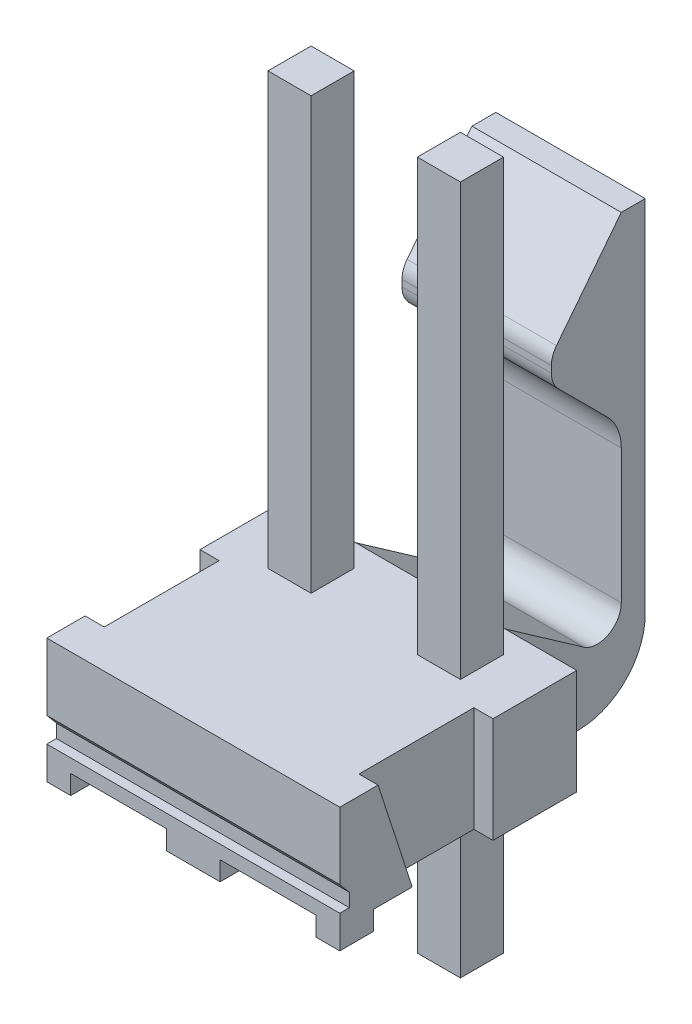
ISO-10303-21;
HEADER;
FILE_DESCRIPTION(('STEP AP214'),'2;1');
FILE_NAME('part.step','',(''),(''),'','','');
FILE_SCHEMA(('AUTOMOTIVE_DESIGN { 1 0 10303 214 1 1 1 1 }'));
ENDSEC;
DATA;
#1=APPLICATION_CONTEXT('core data for automotive mechanical design processes');
#2=APPLICATION_PROTOCOL_DEFINITION('international standard','automotive_design',2000,#1);
#3=PRODUCT_CONTEXT('',#1,'mechanical');
#4=PRODUCT('Part','Part','',(#3));
#5=PRODUCT_RELATED_PRODUCT_CATEGORY('part','',(#4));
#6=PRODUCT_DEFINITION_FORMATION('','',#4);
#7=PRODUCT_DEFINITION_CONTEXT('part definition',#1,'design');
#8=PRODUCT_DEFINITION('design','',#6,#7);
#9=PRODUCT_DEFINITION_SHAPE('','',#8);
#10=(LENGTH_UNIT() NAMED_UNIT(*) SI_UNIT(.MILLI.,.METRE.));
#11=(NAMED_UNIT(*) PLANE_ANGLE_UNIT() SI_UNIT($,.RADIAN.));
#12=(NAMED_UNIT(*) SI_UNIT($,.STERADIAN.) SOLID_ANGLE_UNIT());
#13=UNCERTAINTY_MEASURE_WITH_UNIT(LENGTH_MEASURE(1.E-05),#10,'distance_accuracy_value','');
#14=(GEOMETRIC_REPRESENTATION_CONTEXT(3) GLOBAL_UNCERTAINTY_ASSIGNED_CONTEXT((#13)) GLOBAL_UNIT_ASSIGNED_CONTEXT((#10,
#11,#12)) REPRESENTATION_CONTEXT('',''));
#15=CARTESIAN_POINT('',(0.,0.,0.));
#16=DIRECTION('',(0.,0.,1.));
#17=DIRECTION('',(1.,0.,0.));
#18=AXIS2_PLACEMENT_3D('',#15,#16,#17);
#19=CARTESIAN_POINT('',(1.9812,6.83148419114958,-4.37515));
#20=DIRECTION('',(0.,0.,1.));
#21=DIRECTION('',(1.,0.,0.));
#22=AXIS2_PLACEMENT_3D('',#19,#20,#21);
#23=PLANE('',#22);
#24=DIRECTION('',(1.,0.,0.));
#25=VECTOR('',#24,1.);
#26=CARTESIAN_POINT('',(1.9812,6.65519000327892,-4.37515));
#27=LINE('',#26,#25);
#28=CARTESIAN_POINT('',(1.9812,6.65519000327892,-4.37515));
#29=VERTEX_POINT('',#28);
#30=CARTESIAN_POINT('',(-1.9812,6.65519000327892,-4.37515));
#31=VERTEX_POINT('',#30);
#32=EDGE_CURVE('E676',#29,#31,#27,.F.);
#33=ORIENTED_EDGE('',*,*,#32,.F.);
#34=DIRECTION('',(0.,1.,0.));
#35=VECTOR('',#34,1.);
#36=CARTESIAN_POINT('',(1.9812,6.83148419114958,-4.37515));
#37=LINE('',#36,#35);
#38=CARTESIAN_POINT('',(1.9812,6.83148419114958,-4.37515));
#39=VERTEX_POINT('',#38);
#40=EDGE_CURVE('E675',#29,#39,#37,.T.);
#41=ORIENTED_EDGE('',*,*,#40,.T.);
#42=DIRECTION('',(1.,0.,0.));
#43=VECTOR('',#42,1.);
#44=CARTESIAN_POINT('',(1.9812,6.83148419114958,-4.37515));
#45=LINE('',#44,#43);
#46=CARTESIAN_POINT('',(-1.9812,6.83148419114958,-4.37515));
#47=VERTEX_POINT('',#46);
#48=EDGE_CURVE('E382',#47,#39,#45,.T.);
#49=ORIENTED_EDGE('',*,*,#48,.F.);
#50=DIRECTION('',(0.,1.,0.));
#51=VECTOR('',#50,1.);
#52=CARTESIAN_POINT('',(-1.9812,6.83148419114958,-4.37515));
#53=LINE('',#52,#51);
#54=EDGE_CURVE('E378',#47,#31,#53,.F.);
#55=ORIENTED_EDGE('',*,*,#54,.T.);
#56=EDGE_LOOP('',(#33,#41,#49,#55));
#57=FACE_BOUND('',#56,.T.);
#58=ADVANCED_FACE('F16',(#57),#23,.T.);
#59=CARTESIAN_POINT('',(2.5527,-1.397,3.14325));
#60=DIRECTION('',(1.,0.,0.));
#61=DIRECTION('',(0.,0.,-1.));
#62=AXIS2_PLACEMENT_3D('',#59,#60,#61);
#63=PLANE('',#62);
#64=DIRECTION('',(0.,1.,0.));
#65=VECTOR('',#64,1.);
#66=CARTESIAN_POINT('',(2.5527,-5.461,-2.53365));
#67=LINE('',#66,#65);
#68=CARTESIAN_POINT('',(2.5527,-1.397,-2.53365));
#69=VERTEX_POINT('',#68);
#70=CARTESIAN_POINT('',(2.5527,-5.461,-2.53365));
#71=VERTEX_POINT('',#70);
#72=EDGE_CURVE('E649',#69,#71,#67,.F.);
#73=ORIENTED_EDGE('',*,*,#72,.F.);
#74=DIRECTION('',(0.,0.,-1.));
#75=VECTOR('',#74,1.);
#76=CARTESIAN_POINT('',(2.5527,-1.397,3.14325));
#77=LINE('',#76,#75);
#78=CARTESIAN_POINT('',(2.5527,-1.397,-1.39065));
#79=VERTEX_POINT('',#78);
#80=EDGE_CURVE('E673',#69,#79,#77,.F.);
#81=ORIENTED_EDGE('',*,*,#80,.T.);
#82=DIRECTION('',(0.,1.,0.));
#83=VECTOR('',#82,1.);
#84=CARTESIAN_POINT('',(2.5527,-1.397,-1.39065));
#85=LINE('',#84,#83);
#86=CARTESIAN_POINT('',(2.5527,-5.461,-1.39065));
#87=VERTEX_POINT('',#86);
#88=EDGE_CURVE('E660',#87,#79,#85,.T.);
#89=ORIENTED_EDGE('',*,*,#88,.F.);
#90=DIRECTION('',(0.,0.,-1.));
#91=VECTOR('',#90,1.);
#92=CARTESIAN_POINT('',(2.5527,-5.461,-1.39065));
#93=LINE('',#92,#91);
#94=EDGE_CURVE('E655',#71,#87,#93,.F.);
#95=ORIENTED_EDGE('',*,*,#94,.F.);
#96=EDGE_LOOP('',(#73,#81,#89,#95));
#97=FACE_BOUND('',#96,.T.);
#98=ADVANCED_FACE('F711',(#97),#63,.T.);
#99=CARTESIAN_POINT('',(-1.4097,-1.397,3.14325));
#100=DIRECTION('',(1.,0.,0.));
#101=DIRECTION('',(0.,0.,-1.));
#102=AXIS2_PLACEMENT_3D('',#99,#100,#101);
#103=PLANE('',#102);
#104=DIRECTION('',(0.,1.,0.));
#105=VECTOR('',#104,1.);
#106=CARTESIAN_POINT('',(-1.4097,-5.461,-2.53365));
#107=LINE('',#106,#105);
#108=CARTESIAN_POINT('',(-1.4097,-1.397,-2.53365));
#109=VERTEX_POINT('',#108);
#110=CARTESIAN_POINT('',(-1.4097,-5.461,-2.53365));
#111=VERTEX_POINT('',#110);
#112=EDGE_CURVE('E629',#109,#111,#107,.F.);
#113=ORIENTED_EDGE('',*,*,#112,.F.);
#114=DIRECTION('',(0.,0.,-1.));
#115=VECTOR('',#114,1.);
#116=CARTESIAN_POINT('',(-1.4097,-1.397,3.14325));
#117=LINE('',#116,#115);
#118=CARTESIAN_POINT('',(-1.4097,-1.397,-1.39065));
#119=VERTEX_POINT('',#118);
#120=EDGE_CURVE('E671',#109,#119,#117,.F.);
#121=ORIENTED_EDGE('',*,*,#120,.T.);
#122=DIRECTION('',(0.,1.,0.));
#123=VECTOR('',#122,1.);
#124=CARTESIAN_POINT('',(-1.4097,-1.397,-1.39065));
#125=LINE('',#124,#123);
#126=CARTESIAN_POINT('',(-1.4097,-5.461,-1.39065));
#127=VERTEX_POINT('',#126);
#128=EDGE_CURVE('E640',#127,#119,#125,.T.);
#129=ORIENTED_EDGE('',*,*,#128,.F.);
#130=DIRECTION('',(0.,0.,-1.));
#131=VECTOR('',#130,1.);
#132=CARTESIAN_POINT('',(-1.4097,-5.461,-1.39065));
#133=LINE('',#132,#131);
#134=EDGE_CURVE('E635',#111,#127,#133,.F.);
#135=ORIENTED_EDGE('',*,*,#134,.F.);
#136=EDGE_LOOP('',(#113,#121,#129,#135));
#137=FACE_BOUND('',#136,.T.);
#138=ADVANCED_FACE('F716',(#137),#103,.T.);
#139=CARTESIAN_POINT('',(1.9812,9.4234,-6.86435));
#140=DIRECTION('',(0.,1.,0.));
#141=DIRECTION('',(0.,0.,1.));
#142=AXIS2_PLACEMENT_3D('',#139,#140,#141);
#143=PLANE('',#142);
#144=DIRECTION('',(1.,0.,0.));
#145=VECTOR('',#144,1.);
#146=CARTESIAN_POINT('',(1.9812,9.4234,-6.22935));
#147=LINE('',#146,#145);
#148=CARTESIAN_POINT('',(1.9812,9.4234,-6.22935));
#149=VERTEX_POINT('',#148);
#150=CARTESIAN_POINT('',(-1.9812,9.4234,-6.22935));
#151=VERTEX_POINT('',#150);
#152=EDGE_CURVE('E393',#149,#151,#147,.F.);
#153=ORIENTED_EDGE('',*,*,#152,.F.);
#154=DIRECTION('',(0.,0.,1.));
#155=VECTOR('',#154,1.);
#156=CARTESIAN_POINT('',(1.9812,9.4234,-6.86435));
#157=LINE('',#156,#155);
#158=CARTESIAN_POINT('',(1.9812,9.4234,-6.86435));
#159=VERTEX_POINT('',#158);
#160=EDGE_CURVE('E383',#149,#159,#157,.F.);
#161=ORIENTED_EDGE('',*,*,#160,.T.);
#162=DIRECTION('',(-1.,0.,0.));
#163=VECTOR('',#162,1.);
#164=CARTESIAN_POINT('',(1.9812,9.4234,-6.86435));
#165=LINE('',#164,#163);
#166=CARTESIAN_POINT('',(-1.9812,9.4234,-6.86435));
#167=VERTEX_POINT('',#166);
#168=EDGE_CURVE('E605',#167,#159,#165,.F.);
#169=ORIENTED_EDGE('',*,*,#168,.F.);
#170=DIRECTION('',(0.,0.,1.));
#171=VECTOR('',#170,1.);
#172=CARTESIAN_POINT('',(-1.9812,9.4234,-6.86435));
#173=LINE('',#172,#171);
#174=EDGE_CURVE('E669',#167,#151,#173,.T.);
#175=ORIENTED_EDGE('',*,*,#174,.T.);
#176=EDGE_LOOP('',(#153,#161,#169,#175));
#177=FACE_BOUND('',#176,.T.);
#178=ADVANCED_FACE('F951',(#177),#143,.T.);
#179=CARTESIAN_POINT('',(1.9812,6.83148419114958,-5.01015));
#180=DIRECTION('',(1.,0.,0.));
#181=DIRECTION('',(0.,0.,-1.));
#182=AXIS2_PLACEMENT_3D('',#179,#180,#181);
#183=CYLINDRICAL_SURFACE('',#182,0.635);
#184=ORIENTED_EDGE('',*,*,#48,.T.);
#185=CARTESIAN_POINT('',(1.9812,6.83148419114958,-5.01015));
#186=DIRECTION('',(1.,0.,0.));
#187=DIRECTION('',(0.,0.,-1.));
#188=AXIS2_PLACEMENT_3D('',#185,#186,#187);
#189=CIRCLE('',#188,0.635);
#190=CARTESIAN_POINT('',(1.9812,7.22242922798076,-4.50976317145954));
#191=VERTEX_POINT('',#190);
#192=EDGE_CURVE('E388',#39,#191,#189,.F.);
#193=ORIENTED_EDGE('',*,*,#192,.T.);
#194=DIRECTION('',(1.,0.,0.));
#195=VECTOR('',#194,1.);
#196=CARTESIAN_POINT('',(1.9812,7.22242922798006,-4.50976317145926));
#197=LINE('',#196,#195);
#198=CARTESIAN_POINT('',(-1.9812,7.22242922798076,-4.50976317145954));
#199=VERTEX_POINT('',#198);
#200=EDGE_CURVE('E385',#199,#191,#197,.T.);
#201=ORIENTED_EDGE('',*,*,#200,.F.);
#202=CARTESIAN_POINT('',(-1.9812,6.83148419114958,-5.01015));
#203=DIRECTION('',(1.,0.,0.));
#204=DIRECTION('',(0.,0.,-1.));
#205=AXIS2_PLACEMENT_3D('',#202,#203,#204);
#206=CIRCLE('',#205,0.635);
#207=EDGE_CURVE('E19',#199,#47,#206,.T.);
#208=ORIENTED_EDGE('',*,*,#207,.T.);
#209=EDGE_LOOP('',(#184,#193,#201,#208));
#210=FACE_BOUND('',#209,.T.);
#211=ADVANCED_FACE('F386',(#210),#183,.T.);
#212=CARTESIAN_POINT('',(1.9812,6.65519000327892,-5.01015));
#213=DIRECTION('',(1.,0.,0.));
#214=DIRECTION('',(0.,0.,-1.));
#215=AXIS2_PLACEMENT_3D('',#212,#213,#214);
#216=CYLINDRICAL_SURFACE('',#215,0.635);
#217=DIRECTION('',(1.,0.,0.));
#218=VECTOR('',#217,1.);
#219=CARTESIAN_POINT('',(1.9812,6.20617719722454,-4.56113719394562));
#220=LINE('',#219,#218);
#221=CARTESIAN_POINT('',(1.9812,6.20617719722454,-4.56113719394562));
#222=VERTEX_POINT('',#221);
#223=CARTESIAN_POINT('',(-1.9812,6.20617719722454,-4.56113719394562));
#224=VERTEX_POINT('',#223);
#225=EDGE_CURVE('E392',#222,#224,#220,.F.);
#226=ORIENTED_EDGE('',*,*,#225,.F.);
#227=CARTESIAN_POINT('',(1.9812,6.65519000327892,-5.01015));
#228=DIRECTION('',(1.,0.,0.));
#229=DIRECTION('',(0.,0.,-1.));
#230=AXIS2_PLACEMENT_3D('',#227,#228,#229);
#231=CIRCLE('',#230,0.635);
#232=EDGE_CURVE('E691',#222,#29,#231,.F.);
#233=ORIENTED_EDGE('',*,*,#232,.T.);
#234=ORIENTED_EDGE('',*,*,#32,.T.);
#235=CARTESIAN_POINT('',(-1.9812,6.65519000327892,-5.01015));
#236=DIRECTION('',(1.,0.,0.));
#237=DIRECTION('',(0.,0.,-1.));
#238=AXIS2_PLACEMENT_3D('',#235,#236,#237);
#239=CIRCLE('',#238,0.635);
#240=EDGE_CURVE('E679',#31,#224,#239,.T.);
#241=ORIENTED_EDGE('',*,*,#240,.T.);
#242=EDGE_LOOP('',(#226,#233,#234,#241));
#243=FACE_BOUND('',#242,.T.);
#244=ADVANCED_FACE('F696',(#243),#216,.T.);
#245=CARTESIAN_POINT('',(1.9812,4.01191316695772,-4.95935));
#246=DIRECTION('',(1.,0.,0.));
#247=DIRECTION('',(0.,0.,-1.));
#248=AXIS2_PLACEMENT_3D('',#245,#246,#247);
#249=CYLINDRICAL_SURFACE('',#248,1.27);
#250=CARTESIAN_POINT('',(-1.9812,4.01191316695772,-4.95935));
#251=DIRECTION('',(1.,0.,0.));
#252=DIRECTION('',(0.,0.,-1.));
#253=AXIS2_PLACEMENT_3D('',#250,#251,#252);
#254=CIRCLE('',#253,1.27);
#255=CARTESIAN_POINT('',(-1.9812,4.01191316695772,-6.22935));
#256=VERTEX_POINT('',#255);
#257=CARTESIAN_POINT('',(-1.9812,4.90993877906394,-5.85737561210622));
#258=VERTEX_POINT('',#257);
#259=EDGE_CURVE('E667',#256,#258,#254,.T.);
#260=ORIENTED_EDGE('',*,*,#259,.F.);
#261=DIRECTION('',(1.,0.,0.));
#262=VECTOR('',#261,1.);
#263=CARTESIAN_POINT('',(1.9812,4.01191316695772,-6.22935));
#264=LINE('',#263,#262);
#265=CARTESIAN_POINT('',(1.9812,4.01191316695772,-6.22935));
#266=VERTEX_POINT('',#265);
#267=EDGE_CURVE('E596',#266,#256,#264,.F.);
#268=ORIENTED_EDGE('',*,*,#267,.F.);
#269=CARTESIAN_POINT('',(1.9812,4.01191316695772,-4.95935));
#270=DIRECTION('',(1.,0.,0.));
#271=DIRECTION('',(0.,0.,-1.));
#272=AXIS2_PLACEMENT_3D('',#269,#270,#271);
#273=CIRCLE('',#272,1.27);
#274=CARTESIAN_POINT('',(1.9812,4.90993877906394,-5.85737561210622));
#275=VERTEX_POINT('',#274);
#276=EDGE_CURVE('E689',#275,#266,#273,.F.);
#277=ORIENTED_EDGE('',*,*,#276,.F.);
#278=DIRECTION('',(1.,0.,0.));
#279=VECTOR('',#278,1.);
#280=CARTESIAN_POINT('',(1.9812,4.90993877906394,-5.85737561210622));
#281=LINE('',#280,#279);
#282=EDGE_CURVE('E599',#258,#275,#281,.T.);
#283=ORIENTED_EDGE('',*,*,#282,.F.);
#284=EDGE_LOOP('',(#260,#268,#277,#283));
#285=FACE_BOUND('',#284,.T.);
#286=ADVANCED_FACE('F706',(#285),#249,.F.);
#287=CARTESIAN_POINT('',(-3.8862,-1.905,3.14325));
#288=DIRECTION('',(0.,-1.,0.));
#289=DIRECTION('',(0.,0.,-1.));
#290=AXIS2_PLACEMENT_3D('',#287,#288,#289);
#291=PLANE('',#290);
#292=DIRECTION('',(1.,0.,0.));
#293=VECTOR('',#292,1.);
#294=CARTESIAN_POINT('',(-3.8862,-1.905,3.14325));
#295=LINE('',#294,#293);
#296=CARTESIAN_POINT('',(-0.7112,-1.905,3.14325));
#297=VERTEX_POINT('',#296);
#298=CARTESIAN_POINT('',(0.7112,-1.905,3.14325));
#299=VERTEX_POINT('',#298);
#300=EDGE_CURVE('E556',#297,#299,#295,.T.);
#301=ORIENTED_EDGE('',*,*,#300,.F.);
#302=DIRECTION('',(0.,0.,-1.));
#303=VECTOR('',#302,1.);
#304=CARTESIAN_POINT('',(-0.7112,-1.905,3.14325));
#305=LINE('',#304,#303);
#306=CARTESIAN_POINT('',(-0.7112,-1.905,2.25425));
#307=VERTEX_POINT('',#306);
#308=EDGE_CURVE('E564',#297,#307,#305,.T.);
#309=ORIENTED_EDGE('',*,*,#308,.T.);
#310=DIRECTION('',(-1.,0.,0.));
#311=VECTOR('',#310,1.);
#312=CARTESIAN_POINT('',(-3.8862,-1.905,2.25425));
#313=LINE('',#312,#311);
#314=CARTESIAN_POINT('',(0.7112,-1.905,2.25425));
#315=VERTEX_POINT('',#314);
#316=EDGE_CURVE('E566',#315,#307,#313,.T.);
#317=ORIENTED_EDGE('',*,*,#316,.F.);
#318=DIRECTION('',(0.,0.,1.));
#319=VECTOR('',#318,1.);
#320=CARTESIAN_POINT('',(0.7112,-1.905,3.14325));
#321=LINE('',#320,#319);
#322=EDGE_CURVE('E572',#315,#299,#321,.T.);
#323=ORIENTED_EDGE('',*,*,#322,.T.);
#324=EDGE_LOOP('',(#301,#309,#317,#323));
#325=FACE_BOUND('',#324,.T.);
#326=ADVANCED_FACE('F940',(#325),#291,.T.);
#327=CARTESIAN_POINT('',(-3.8862,-1.03930541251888,2.88925));
#328=DIRECTION('',(0.,1.,0.));
#329=DIRECTION('',(0.,0.,1.));
#330=AXIS2_PLACEMENT_3D('',#327,#328,#329);
#331=PLANE('',#330);
#332=DIRECTION('',(1.,0.,0.));
#333=VECTOR('',#332,1.);
#334=CARTESIAN_POINT('',(-3.8862,-1.03930541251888,2.88925));
#335=LINE('',#334,#333);
#336=CARTESIAN_POINT('',(-3.8862,-1.03930541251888,2.88925));
#337=VERTEX_POINT('',#336);
#338=CARTESIAN_POINT('',(3.8862,-1.03930541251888,2.88925));
#339=VERTEX_POINT('',#338);
#340=EDGE_CURVE('E620',#337,#339,#335,.T.);
#341=ORIENTED_EDGE('',*,*,#340,.F.);
#342=DIRECTION('',(0.,0.,1.));
#343=VECTOR('',#342,1.);
#344=CARTESIAN_POINT('',(-3.8862,-1.03930541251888,2.88925));
#345=LINE('',#344,#343);
#346=CARTESIAN_POINT('',(-3.8862,-1.03930541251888,3.14325));
#347=VERTEX_POINT('',#346);
#348=EDGE_CURVE('E663',#337,#347,#345,.T.);
#349=ORIENTED_EDGE('',*,*,#348,.T.);
#350=DIRECTION('',(1.,0.,0.));
#351=VECTOR('',#350,1.);
#352=CARTESIAN_POINT('',(-3.8862,-1.03930541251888,3.14325));
#353=LINE('',#352,#351);
#354=CARTESIAN_POINT('',(3.8862,-1.03930541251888,3.14325));
#355=VERTEX_POINT('',#354);
#356=EDGE_CURVE('E546',#355,#347,#353,.F.);
#357=ORIENTED_EDGE('',*,*,#356,.F.);
#358=DIRECTION('',(0.,0.,1.));
#359=VECTOR('',#358,1.);
#360=CARTESIAN_POINT('',(3.8862,-1.03930541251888,2.88925));
#361=LINE('',#360,#359);
#362=EDGE_CURVE('E665',#355,#339,#361,.F.);
#363=ORIENTED_EDGE('',*,*,#362,.T.);
#364=EDGE_LOOP('',(#341,#349,#357,#363));
#365=FACE_BOUND('',#364,.T.);
#366=ADVANCED_FACE('F936',(#365),#331,.T.);
#367=CARTESIAN_POINT('',(1.4097,-1.397,-1.39065));
#368=DIRECTION('',(0.,0.,1.));
#369=DIRECTION('',(1.,0.,0.));
#370=AXIS2_PLACEMENT_3D('',#367,#368,#369);
#371=PLANE('',#370);
#372=ORIENTED_EDGE('',*,*,#88,.T.);
#373=DIRECTION('',(1.,0.,0.));
#374=VECTOR('',#373,1.);
#375=CARTESIAN_POINT('',(1.4097,-1.397,-1.39065));
#376=LINE('',#375,#374);
#377=CARTESIAN_POINT('',(1.4097,-1.397,-1.39065));
#378=VERTEX_POINT('',#377);
#379=EDGE_CURVE('E658',#79,#378,#376,.F.);
#380=ORIENTED_EDGE('',*,*,#379,.T.);
#381=DIRECTION('',(0.,1.,0.));
#382=VECTOR('',#381,1.);
#383=CARTESIAN_POINT('',(1.4097,-1.397,-1.39065));
#384=LINE('',#383,#382);
#385=CARTESIAN_POINT('',(1.4097,-5.461,-1.39065));
#386=VERTEX_POINT('',#385);
#387=EDGE_CURVE('E531',#378,#386,#384,.F.);
#388=ORIENTED_EDGE('',*,*,#387,.T.);
#389=DIRECTION('',(1.,0.,0.));
#390=VECTOR('',#389,1.);
#391=CARTESIAN_POINT('',(1.4097,-5.461,-1.39065));
#392=LINE('',#391,#390);
#393=EDGE_CURVE('E652',#87,#386,#392,.F.);
#394=ORIENTED_EDGE('',*,*,#393,.F.);
#395=EDGE_LOOP('',(#372,#380,#388,#394));
#396=FACE_BOUND('',#395,.T.);
#397=ADVANCED_FACE('F932',(#396),#371,.T.);
#398=CARTESIAN_POINT('',(1.4097,-5.461,-1.39065));
#399=DIRECTION('',(0.,-1.,0.));
#400=DIRECTION('',(0.,0.,-1.));
#401=AXIS2_PLACEMENT_3D('',#398,#399,#400);
#402=PLANE('',#401);
#403=ORIENTED_EDGE('',*,*,#393,.T.);
#404=DIRECTION('',(0.,0.,-1.));
#405=VECTOR('',#404,1.);
#406=CARTESIAN_POINT('',(1.4097,-5.461,3.14325));
#407=LINE('',#406,#405);
#408=CARTESIAN_POINT('',(1.4097,-5.461,-2.53365));
#409=VERTEX_POINT('',#408);
#410=EDGE_CURVE('E529',#386,#409,#407,.T.);
#411=ORIENTED_EDGE('',*,*,#410,.T.);
#412=DIRECTION('',(-1.,0.,0.));
#413=VECTOR('',#412,1.);
#414=CARTESIAN_POINT('',(1.4097,-5.461,-2.53365));
#415=LINE('',#414,#413);
#416=EDGE_CURVE('E646',#71,#409,#415,.T.);
#417=ORIENTED_EDGE('',*,*,#416,.F.);
#418=ORIENTED_EDGE('',*,*,#94,.T.);
#419=EDGE_LOOP('',(#403,#411,#417,#418));
#420=FACE_BOUND('',#419,.T.);
#421=ADVANCED_FACE('F928',(#420),#402,.T.);
#422=CARTESIAN_POINT('',(1.4097,-5.461,-2.53365));
#423=DIRECTION('',(0.,0.,-1.));
#424=DIRECTION('',(-1.,0.,0.));
#425=AXIS2_PLACEMENT_3D('',#422,#423,#424);
#426=PLANE('',#425);
#427=DIRECTION('',(0.,1.,0.));
#428=VECTOR('',#427,1.);
#429=CARTESIAN_POINT('',(1.4097,-1.397,-2.53365));
#430=LINE('',#429,#428);
#431=CARTESIAN_POINT('',(1.4097,-1.397,-2.53365));
#432=VERTEX_POINT('',#431);
#433=EDGE_CURVE('E526',#409,#432,#430,.T.);
#434=ORIENTED_EDGE('',*,*,#433,.T.);
#435=DIRECTION('',(-1.,0.,0.));
#436=VECTOR('',#435,1.);
#437=CARTESIAN_POINT('',(1.4097,-1.397,-2.53365));
#438=LINE('',#437,#436);
#439=EDGE_CURVE('E643',#432,#69,#438,.F.);
#440=ORIENTED_EDGE('',*,*,#439,.T.);
#441=ORIENTED_EDGE('',*,*,#72,.T.);
#442=ORIENTED_EDGE('',*,*,#416,.T.);
#443=EDGE_LOOP('',(#434,#440,#441,#442));
#444=FACE_BOUND('',#443,.T.);
#445=ADVANCED_FACE('F924',(#444),#426,.T.);
#446=CARTESIAN_POINT('',(-2.5527,-1.397,-1.39065));
#447=DIRECTION('',(0.,0.,1.));
#448=DIRECTION('',(1.,0.,0.));
#449=AXIS2_PLACEMENT_3D('',#446,#447,#448);
#450=PLANE('',#449);
#451=ORIENTED_EDGE('',*,*,#128,.T.);
#452=DIRECTION('',(1.,0.,0.));
#453=VECTOR('',#452,1.);
#454=CARTESIAN_POINT('',(-2.5527,-1.397,-1.39065));
#455=LINE('',#454,#453);
#456=CARTESIAN_POINT('',(-2.5527,-1.397,-1.39065));
#457=VERTEX_POINT('',#456);
#458=EDGE_CURVE('E638',#119,#457,#455,.F.);
#459=ORIENTED_EDGE('',*,*,#458,.T.);
#460=DIRECTION('',(0.,1.,0.));
#461=VECTOR('',#460,1.);
#462=CARTESIAN_POINT('',(-2.5527,-1.397,-1.39065));
#463=LINE('',#462,#461);
#464=CARTESIAN_POINT('',(-2.5527,-5.461,-1.39065));
#465=VERTEX_POINT('',#464);
#466=EDGE_CURVE('E524',#457,#465,#463,.F.);
#467=ORIENTED_EDGE('',*,*,#466,.T.);
#468=DIRECTION('',(1.,0.,0.));
#469=VECTOR('',#468,1.);
#470=CARTESIAN_POINT('',(-2.5527,-5.461,-1.39065));
#471=LINE('',#470,#469);
#472=EDGE_CURVE('E632',#127,#465,#471,.F.);
#473=ORIENTED_EDGE('',*,*,#472,.F.);
#474=EDGE_LOOP('',(#451,#459,#467,#473));
#475=FACE_BOUND('',#474,.T.);
#476=ADVANCED_FACE('F920',(#475),#450,.T.);
#477=CARTESIAN_POINT('',(-2.5527,-5.461,-1.39065));
#478=DIRECTION('',(0.,-1.,0.));
#479=DIRECTION('',(0.,0.,-1.));
#480=AXIS2_PLACEMENT_3D('',#477,#478,#479);
#481=PLANE('',#480);
#482=ORIENTED_EDGE('',*,*,#472,.T.);
#483=DIRECTION('',(0.,0.,-1.));
#484=VECTOR('',#483,1.);
#485=CARTESIAN_POINT('',(-2.5527,-5.461,3.14325));
#486=LINE('',#485,#484);
#487=CARTESIAN_POINT('',(-2.5527,-5.461,-2.53365));
#488=VERTEX_POINT('',#487);
#489=EDGE_CURVE('E522',#465,#488,#486,.T.);
#490=ORIENTED_EDGE('',*,*,#489,.T.);
#491=DIRECTION('',(-1.,0.,0.));
#492=VECTOR('',#491,1.);
#493=CARTESIAN_POINT('',(-2.5527,-5.461,-2.53365));
#494=LINE('',#493,#492);
#495=EDGE_CURVE('E626',#111,#488,#494,.T.);
#496=ORIENTED_EDGE('',*,*,#495,.F.);
#497=ORIENTED_EDGE('',*,*,#134,.T.);
#498=EDGE_LOOP('',(#482,#490,#496,#497));
#499=FACE_BOUND('',#498,.T.);
#500=ADVANCED_FACE('F916',(#499),#481,.T.);
#501=CARTESIAN_POINT('',(-2.5527,-5.461,-2.53365));
#502=DIRECTION('',(0.,0.,-1.));
#503=DIRECTION('',(-1.,0.,0.));
#504=AXIS2_PLACEMENT_3D('',#501,#502,#503);
#505=PLANE('',#504);
#506=DIRECTION('',(0.,1.,0.));
#507=VECTOR('',#506,1.);
#508=CARTESIAN_POINT('',(-2.5527,-1.397,-2.53365));
#509=LINE('',#508,#507);
#510=CARTESIAN_POINT('',(-2.5527,-1.397,-2.53365));
#511=VERTEX_POINT('',#510);
#512=EDGE_CURVE('E519',#488,#511,#509,.T.);
#513=ORIENTED_EDGE('',*,*,#512,.T.);
#514=DIRECTION('',(-1.,0.,0.));
#515=VECTOR('',#514,1.);
#516=CARTESIAN_POINT('',(-2.5527,-1.397,-2.53365));
#517=LINE('',#516,#515);
#518=EDGE_CURVE('E623',#511,#109,#517,.F.);
#519=ORIENTED_EDGE('',*,*,#518,.T.);
#520=ORIENTED_EDGE('',*,*,#112,.T.);
#521=ORIENTED_EDGE('',*,*,#495,.T.);
#522=EDGE_LOOP('',(#513,#519,#520,#521));
#523=FACE_BOUND('',#522,.T.);
#524=ADVANCED_FACE('F912',(#523),#505,.T.);
#525=CARTESIAN_POINT('',(-3.8862,-0.683705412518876,2.88925));
#526=DIRECTION('',(0.,0.,1.));
#527=DIRECTION('',(1.,0.,0.));
#528=AXIS2_PLACEMENT_3D('',#525,#526,#527);
#529=PLANE('',#528);
#530=DIRECTION('',(1.,0.,0.));
#531=VECTOR('',#530,1.);
#532=CARTESIAN_POINT('',(-3.8862,-0.683705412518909,2.88925000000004));
#533=LINE('',#532,#531);
#534=CARTESIAN_POINT('',(-3.8862,-0.683705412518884,2.88925000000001));
#535=VERTEX_POINT('',#534);
#536=CARTESIAN_POINT('',(3.8862,-0.683705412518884,2.88925000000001));
#537=VERTEX_POINT('',#536);
#538=EDGE_CURVE('E512',#535,#537,#533,.T.);
#539=ORIENTED_EDGE('',*,*,#538,.F.);
#540=DIRECTION('',(0.,1.,0.));
#541=VECTOR('',#540,1.);
#542=CARTESIAN_POINT('',(-3.8862,-0.683705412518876,2.88925));
#543=LINE('',#542,#541);
#544=EDGE_CURVE('E614',#535,#337,#543,.F.);
#545=ORIENTED_EDGE('',*,*,#544,.T.);
#546=ORIENTED_EDGE('',*,*,#340,.T.);
#547=DIRECTION('',(0.,1.,0.));
#548=VECTOR('',#547,1.);
#549=CARTESIAN_POINT('',(3.8862,-0.683705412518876,2.88925));
#550=LINE('',#549,#548);
#551=EDGE_CURVE('E618',#339,#537,#550,.T.);
#552=ORIENTED_EDGE('',*,*,#551,.T.);
#553=EDGE_LOOP('',(#539,#545,#546,#552));
#554=FACE_BOUND('',#553,.T.);
#555=ADVANCED_FACE('F908',(#554),#529,.T.);
#556=CARTESIAN_POINT('',(-3.8862,-1.905,3.14325));
#557=DIRECTION('',(0.,-1.,0.));
#558=DIRECTION('',(0.,0.,-1.));
#559=AXIS2_PLACEMENT_3D('',#556,#557,#558);
#560=PLANE('',#559);
#561=DIRECTION('',(1.,0.,0.));
#562=VECTOR('',#561,1.);
#563=CARTESIAN_POINT('',(-3.8862,-1.905,3.14325));
#564=LINE('',#563,#562);
#565=CARTESIAN_POINT('',(3.2512,-1.905,3.14325));
#566=VERTEX_POINT('',#565);
#567=CARTESIAN_POINT('',(3.8862,-1.905,3.14325));
#568=VERTEX_POINT('',#567);
#569=EDGE_CURVE('E549',#566,#568,#564,.T.);
#570=ORIENTED_EDGE('',*,*,#569,.F.);
#571=DIRECTION('',(0.,0.,-1.));
#572=VECTOR('',#571,1.);
#573=CARTESIAN_POINT('',(3.2512,-1.905,3.14325));
#574=LINE('',#573,#572);
#575=CARTESIAN_POINT('',(3.2512,-1.905,2.25425));
#576=VERTEX_POINT('',#575);
#577=EDGE_CURVE('E576',#566,#576,#574,.T.);
#578=ORIENTED_EDGE('',*,*,#577,.T.);
#579=DIRECTION('',(-1.,0.,0.));
#580=VECTOR('',#579,1.);
#581=CARTESIAN_POINT('',(-3.8862,-1.905,2.25425));
#582=LINE('',#581,#580);
#583=CARTESIAN_POINT('',(3.8862,-1.905,2.25425));
#584=VERTEX_POINT('',#583);
#585=EDGE_CURVE('E578',#584,#576,#582,.T.);
#586=ORIENTED_EDGE('',*,*,#585,.F.);
#587=DIRECTION('',(0.,0.,-1.));
#588=VECTOR('',#587,1.);
#589=CARTESIAN_POINT('',(3.8862,-1.905,0.));
#590=LINE('',#589,#588);
#591=EDGE_CURVE('E501',#568,#584,#590,.T.);
#592=ORIENTED_EDGE('',*,*,#591,.F.);
#593=EDGE_LOOP('',(#570,#578,#586,#592));
#594=FACE_BOUND('',#593,.T.);
#595=ADVANCED_FACE('F904',(#594),#560,.T.);
#596=CARTESIAN_POINT('',(-3.8862,-1.905,3.14325));
#597=DIRECTION('',(0.,-1.,0.));
#598=DIRECTION('',(0.,0.,-1.));
#599=AXIS2_PLACEMENT_3D('',#596,#597,#598);
#600=PLANE('',#599);
#601=DIRECTION('',(-1.,0.,0.));
#602=VECTOR('',#601,1.);
#603=CARTESIAN_POINT('',(-3.8862,-1.905,2.25425));
#604=LINE('',#603,#602);
#605=CARTESIAN_POINT('',(-3.2512,-1.905,2.25425));
#606=VERTEX_POINT('',#605);
#607=CARTESIAN_POINT('',(-3.8862,-1.905,2.25425));
#608=VERTEX_POINT('',#607);
#609=EDGE_CURVE('E536',#606,#608,#604,.T.);
#610=ORIENTED_EDGE('',*,*,#609,.F.);
#611=DIRECTION('',(0.,0.,1.));
#612=VECTOR('',#611,1.);
#613=CARTESIAN_POINT('',(-3.2512,-1.905,3.14325));
#614=LINE('',#613,#612);
#615=CARTESIAN_POINT('',(-3.2512,-1.905,3.14325));
#616=VERTEX_POINT('',#615);
#617=EDGE_CURVE('E541',#606,#616,#614,.T.);
#618=ORIENTED_EDGE('',*,*,#617,.T.);
#619=DIRECTION('',(1.,0.,0.));
#620=VECTOR('',#619,1.);
#621=CARTESIAN_POINT('',(-3.8862,-1.905,3.14325));
#622=LINE('',#621,#620);
#623=CARTESIAN_POINT('',(-3.8862,-1.905,3.14325));
#624=VERTEX_POINT('',#623);
#625=EDGE_CURVE('E543',#624,#616,#622,.T.);
#626=ORIENTED_EDGE('',*,*,#625,.F.);
#627=DIRECTION('',(0.,0.,-1.));
#628=VECTOR('',#627,1.);
#629=CARTESIAN_POINT('',(-3.8862,-1.905,0.));
#630=LINE('',#629,#628);
#631=EDGE_CURVE('E489',#624,#608,#630,.T.);
#632=ORIENTED_EDGE('',*,*,#631,.T.);
#633=EDGE_LOOP('',(#610,#618,#626,#632));
#634=FACE_BOUND('',#633,.T.);
#635=ADVANCED_FACE('F900',(#634),#600,.T.);
#636=CARTESIAN_POINT('',(1.9812,-1.905,-3.14325));
#637=DIRECTION('',(0.,-1.,0.));
#638=DIRECTION('',(0.,0.,-1.));
#639=AXIS2_PLACEMENT_3D('',#636,#637,#638);
#640=PLANE('',#639);
#641=DIRECTION('',(1.,0.,0.));
#642=VECTOR('',#641,1.);
#643=CARTESIAN_POINT('',(1.9812,-1.905,-5.08635));
#644=LINE('',#643,#642);
#645=CARTESIAN_POINT('',(1.9812,-1.905,-5.08635));
#646=VERTEX_POINT('',#645);
#647=CARTESIAN_POINT('',(-1.9812,-1.905,-5.08635));
#648=VERTEX_POINT('',#647);
#649=EDGE_CURVE('E609',#646,#648,#644,.F.);
#650=ORIENTED_EDGE('',*,*,#649,.F.);
#651=DIRECTION('',(0.,0.,-1.));
#652=VECTOR('',#651,1.);
#653=CARTESIAN_POINT('',(1.9812,-1.905,0.));
#654=LINE('',#653,#652);
#655=CARTESIAN_POINT('',(1.9812,-1.905,-3.14325));
#656=VERTEX_POINT('',#655);
#657=EDGE_CURVE('E447',#656,#646,#654,.T.);
#658=ORIENTED_EDGE('',*,*,#657,.F.);
#659=DIRECTION('',(1.,0.,0.));
#660=VECTOR('',#659,1.);
#661=CARTESIAN_POINT('',(1.9812,-1.905,-3.14325));
#662=LINE('',#661,#660);
#663=CARTESIAN_POINT('',(-1.9812,-1.905,-3.14325));
#664=VERTEX_POINT('',#663);
#665=EDGE_CURVE('E581',#664,#656,#662,.T.);
#666=ORIENTED_EDGE('',*,*,#665,.F.);
#667=DIRECTION('',(0.,0.,-1.));
#668=VECTOR('',#667,1.);
#669=CARTESIAN_POINT('',(-1.9812,-1.905,0.));
#670=LINE('',#669,#668);
#671=EDGE_CURVE('E409',#664,#648,#670,.T.);
#672=ORIENTED_EDGE('',*,*,#671,.T.);
#673=EDGE_LOOP('',(#650,#658,#666,#672));
#674=FACE_BOUND('',#673,.T.);
#675=ADVANCED_FACE('F896',(#674),#640,.T.);
#676=CARTESIAN_POINT('',(1.9812,-0.127,-5.08635));
#677=DIRECTION('',(1.,0.,0.));
#678=DIRECTION('',(0.,0.,-1.));
#679=AXIS2_PLACEMENT_3D('',#676,#677,#678);
#680=CYLINDRICAL_SURFACE('',#679,1.778);
#681=DIRECTION('',(-1.,0.,0.));
#682=VECTOR('',#681,1.);
#683=CARTESIAN_POINT('',(1.9812,-0.127,-6.86435));
#684=LINE('',#683,#682);
#685=CARTESIAN_POINT('',(1.9812,-0.127,-6.86435));
#686=VERTEX_POINT('',#685);
#687=CARTESIAN_POINT('',(-1.9812,-0.127,-6.86435));
#688=VERTEX_POINT('',#687);
#689=EDGE_CURVE('E606',#686,#688,#684,.T.);
#690=ORIENTED_EDGE('',*,*,#689,.F.);
#691=CARTESIAN_POINT('',(1.9812,-0.127,-5.08635));
#692=DIRECTION('',(1.,0.,0.));
#693=DIRECTION('',(0.,0.,-1.));
#694=AXIS2_PLACEMENT_3D('',#691,#692,#693);
#695=CIRCLE('',#694,1.778);
#696=EDGE_CURVE('E446',#646,#686,#695,.T.);
#697=ORIENTED_EDGE('',*,*,#696,.F.);
#698=ORIENTED_EDGE('',*,*,#649,.T.);
#699=CARTESIAN_POINT('',(-1.9812,-0.127,-5.08635));
#700=DIRECTION('',(1.,0.,0.));
#701=DIRECTION('',(0.,0.,-1.));
#702=AXIS2_PLACEMENT_3D('',#699,#700,#701);
#703=CIRCLE('',#702,1.778);
#704=EDGE_CURVE('E405',#648,#688,#703,.T.);
#705=ORIENTED_EDGE('',*,*,#704,.T.);
#706=EDGE_LOOP('',(#690,#697,#698,#705));
#707=FACE_BOUND('',#706,.T.);
#708=ADVANCED_FACE('F892',(#707),#680,.T.);
#709=CARTESIAN_POINT('',(1.9812,-0.127,-6.86435));
#710=DIRECTION('',(0.,0.,-1.));
#711=DIRECTION('',(-1.,0.,0.));
#712=AXIS2_PLACEMENT_3D('',#709,#710,#711);
#713=PLANE('',#712);
#714=ORIENTED_EDGE('',*,*,#168,.T.);
#715=DIRECTION('',(0.,1.,0.));
#716=VECTOR('',#715,1.);
#717=CARTESIAN_POINT('',(1.9812,0.,-6.86435));
#718=LINE('',#717,#716);
#719=EDGE_CURVE('E443',#686,#159,#718,.T.);
#720=ORIENTED_EDGE('',*,*,#719,.F.);
#721=ORIENTED_EDGE('',*,*,#689,.T.);
#722=DIRECTION('',(0.,1.,0.));
#723=VECTOR('',#722,1.);
#724=CARTESIAN_POINT('',(-1.9812,0.,-6.86435));
#725=LINE('',#724,#723);
#726=EDGE_CURVE('E399',#688,#167,#725,.T.);
#727=ORIENTED_EDGE('',*,*,#726,.T.);
#728=EDGE_LOOP('',(#714,#720,#721,#727));
#729=FACE_BOUND('',#728,.T.);
#730=ADVANCED_FACE('F889',(#729),#713,.T.);
#731=CARTESIAN_POINT('',(1.9812,9.4234,-6.22935));
#732=DIRECTION('',(0.,0.615661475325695,0.788010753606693));
#733=DIRECTION('',(0.,-0.788010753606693,0.615661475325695));
#734=AXIS2_PLACEMENT_3D('',#731,#732,#733);
#735=PLANE('',#734);
#736=ORIENTED_EDGE('',*,*,#200,.T.);
#737=DIRECTION('',(0.,-0.788010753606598,0.615661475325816));
#738=VECTOR('',#737,1.);
#739=CARTESIAN_POINT('',(1.9812,9.4234,-6.22935));
#740=LINE('',#739,#738);
#741=EDGE_CURVE('E441',#149,#191,#740,.T.);
#742=ORIENTED_EDGE('',*,*,#741,.F.);
#743=ORIENTED_EDGE('',*,*,#152,.T.);
#744=DIRECTION('',(0.,-0.788010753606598,0.615661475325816));
#745=VECTOR('',#744,1.);
#746=CARTESIAN_POINT('',(-1.9812,9.4234,-6.22935));
#747=LINE('',#746,#745);
#748=EDGE_CURVE('E376',#151,#199,#747,.T.);
#749=ORIENTED_EDGE('',*,*,#748,.T.);
#750=EDGE_LOOP('',(#736,#742,#743,#749));
#751=FACE_BOUND('',#750,.T.);
#752=ADVANCED_FACE('F396',(#751),#735,.T.);
#753=CARTESIAN_POINT('',(1.9812,6.20617719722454,-4.56113719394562));
#754=DIRECTION('',(0.,-0.707106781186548,0.707106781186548));
#755=DIRECTION('',(0.,-0.707106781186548,-0.707106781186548));
#756=AXIS2_PLACEMENT_3D('',#753,#754,#755);
#757=PLANE('',#756);
#758=ORIENTED_EDGE('',*,*,#282,.T.);
#759=DIRECTION('',(0.,-0.707106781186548,-0.707106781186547));
#760=VECTOR('',#759,1.);
#761=CARTESIAN_POINT('',(1.9812,6.20617719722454,-4.56113719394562));
#762=LINE('',#761,#760);
#763=EDGE_CURVE('E438',#222,#275,#762,.T.);
#764=ORIENTED_EDGE('',*,*,#763,.F.);
#765=ORIENTED_EDGE('',*,*,#225,.T.);
#766=DIRECTION('',(0.,-0.707106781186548,-0.707106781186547));
#767=VECTOR('',#766,1.);
#768=CARTESIAN_POINT('',(-1.9812,6.20617719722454,-4.56113719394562));
#769=LINE('',#768,#767);
#770=EDGE_CURVE('E398',#224,#258,#769,.T.);
#771=ORIENTED_EDGE('',*,*,#770,.T.);
#772=EDGE_LOOP('',(#758,#764,#765,#771));
#773=FACE_BOUND('',#772,.T.);
#774=ADVANCED_FACE('F701',(#773),#757,.T.);
#775=CARTESIAN_POINT('',(1.9812,4.01191316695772,-6.22935));
#776=DIRECTION('',(0.,0.,1.));
#777=DIRECTION('',(1.,0.,0.));
#778=AXIS2_PLACEMENT_3D('',#775,#776,#777);
#779=PLANE('',#778);
#780=DIRECTION('',(1.,0.,0.));
#781=VECTOR('',#780,1.);
#782=CARTESIAN_POINT('',(1.9812,0.45591316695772,-6.22935));
#783=LINE('',#782,#781);
#784=CARTESIAN_POINT('',(-1.9812,0.45591316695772,-6.22935));
#785=VERTEX_POINT('',#784);
#786=CARTESIAN_POINT('',(1.9812,0.45591316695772,-6.22935));
#787=VERTEX_POINT('',#786);
#788=EDGE_CURVE('E593',#785,#787,#783,.T.);
#789=ORIENTED_EDGE('',*,*,#788,.T.);
#790=DIRECTION('',(0.,1.,0.));
#791=VECTOR('',#790,1.);
#792=CARTESIAN_POINT('',(1.9812,0.,-6.22935));
#793=LINE('',#792,#791);
#794=EDGE_CURVE('E435',#266,#787,#793,.F.);
#795=ORIENTED_EDGE('',*,*,#794,.F.);
#796=ORIENTED_EDGE('',*,*,#267,.T.);
#797=DIRECTION('',(0.,1.,0.));
#798=VECTOR('',#797,1.);
#799=CARTESIAN_POINT('',(-1.9812,0.,-6.22935));
#800=LINE('',#799,#798);
#801=EDGE_CURVE('E402',#256,#785,#800,.F.);
#802=ORIENTED_EDGE('',*,*,#801,.T.);
#803=EDGE_LOOP('',(#789,#795,#796,#802));
#804=FACE_BOUND('',#803,.T.);
#805=ADVANCED_FACE('F880',(#804),#779,.T.);
#806=CARTESIAN_POINT('',(1.9812,1.397,-3.14325));
#807=DIRECTION('',(0.,0.,1.));
#808=DIRECTION('',(1.,0.,0.));
#809=AXIS2_PLACEMENT_3D('',#806,#807,#808);
#810=PLANE('',#809);
#811=DIRECTION('',(0.,1.,0.));
#812=VECTOR('',#811,1.);
#813=CARTESIAN_POINT('',(1.9812,0.,-3.14325));
#814=LINE('',#813,#812);
#815=CARTESIAN_POINT('',(1.9812,-1.397,-3.14325));
#816=VERTEX_POINT('',#815);
#817=EDGE_CURVE('E450',#816,#656,#814,.F.);
#818=ORIENTED_EDGE('',*,*,#817,.F.);
#819=DIRECTION('',(1.,0.,0.));
#820=VECTOR('',#819,1.);
#821=CARTESIAN_POINT('',(-3.8862,-1.397,-3.14325));
#822=LINE('',#821,#820);
#823=CARTESIAN_POINT('',(-1.9812,-1.397,-3.14325));
#824=VERTEX_POINT('',#823);
#825=EDGE_CURVE('E463',#824,#816,#822,.T.);
#826=ORIENTED_EDGE('',*,*,#825,.F.);
#827=DIRECTION('',(0.,1.,0.));
#828=VECTOR('',#827,1.);
#829=CARTESIAN_POINT('',(-1.9812,0.,-3.14325));
#830=LINE('',#829,#828);
#831=EDGE_CURVE('E411',#824,#664,#830,.F.);
#832=ORIENTED_EDGE('',*,*,#831,.T.);
#833=ORIENTED_EDGE('',*,*,#665,.T.);
#834=EDGE_LOOP('',(#818,#826,#832,#833));
#835=FACE_BOUND('',#834,.T.);
#836=ADVANCED_FACE('F876',(#835),#810,.T.);
#837=CARTESIAN_POINT('',(-3.8862,-1.905,2.25425));
#838=DIRECTION('',(0.,0.,-1.));
#839=DIRECTION('',(-1.,0.,0.));
#840=AXIS2_PLACEMENT_3D('',#837,#838,#839);
#841=PLANE('',#840);
#842=ORIENTED_EDGE('',*,*,#585,.T.);
#843=DIRECTION('',(0.,1.,0.));
#844=VECTOR('',#843,1.);
#845=CARTESIAN_POINT('',(3.2512,-1.905,2.25425));
#846=LINE('',#845,#844);
#847=CARTESIAN_POINT('',(3.2512,-1.397,2.25425));
#848=VERTEX_POINT('',#847);
#849=EDGE_CURVE('E574',#576,#848,#846,.T.);
#850=ORIENTED_EDGE('',*,*,#849,.T.);
#851=DIRECTION('',(1.,0.,0.));
#852=VECTOR('',#851,1.);
#853=CARTESIAN_POINT('',(-3.8862,-1.397,2.25425));
#854=LINE('',#853,#852);
#855=CARTESIAN_POINT('',(3.8862,-1.397,2.25425));
#856=VERTEX_POINT('',#855);
#857=EDGE_CURVE('E1006',#856,#848,#854,.F.);
#858=ORIENTED_EDGE('',*,*,#857,.F.);
#859=DIRECTION('',(0.,1.,0.));
#860=VECTOR('',#859,1.);
#861=CARTESIAN_POINT('',(3.8862,0.,2.25425));
#862=LINE('',#861,#860);
#863=EDGE_CURVE('E499',#584,#856,#862,.T.);
#864=ORIENTED_EDGE('',*,*,#863,.F.);
#865=EDGE_LOOP('',(#842,#850,#858,#864));
#866=FACE_BOUND('',#865,.T.);
#867=ADVANCED_FACE('F872',(#866),#841,.T.);
#868=CARTESIAN_POINT('',(3.2512,-1.905,3.14325));
#869=DIRECTION('',(1.,0.,0.));
#870=DIRECTION('',(0.,0.,-1.));
#871=AXIS2_PLACEMENT_3D('',#868,#869,#870);
#872=PLANE('',#871);
#873=DIRECTION('',(0.,0.,-1.));
#874=VECTOR('',#873,1.);
#875=CARTESIAN_POINT('',(3.2512,-1.397,2.25425));
#876=LINE('',#875,#874);
#877=CARTESIAN_POINT('',(3.2512,-1.397,3.14325));
#878=VERTEX_POINT('',#877);
#879=EDGE_CURVE('E1003',#848,#878,#876,.F.);
#880=ORIENTED_EDGE('',*,*,#879,.F.);
#881=ORIENTED_EDGE('',*,*,#849,.F.);
#882=ORIENTED_EDGE('',*,*,#577,.F.);
#883=DIRECTION('',(0.,1.,0.));
#884=VECTOR('',#883,1.);
#885=CARTESIAN_POINT('',(3.2512,-1.03930541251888,3.14325));
#886=LINE('',#885,#884);
#887=EDGE_CURVE('E551',#878,#566,#886,.F.);
#888=ORIENTED_EDGE('',*,*,#887,.F.);
#889=EDGE_LOOP('',(#880,#881,#882,#888));
#890=FACE_BOUND('',#889,.T.);
#891=ADVANCED_FACE('F868',(#890),#872,.F.);
#892=CARTESIAN_POINT('',(0.7112,-1.397,3.14325));
#893=DIRECTION('',(-1.,0.,0.));
#894=DIRECTION('',(0.,0.,1.));
#895=AXIS2_PLACEMENT_3D('',#892,#893,#894);
#896=PLANE('',#895);
#897=DIRECTION('',(0.,0.,-1.));
#898=VECTOR('',#897,1.);
#899=CARTESIAN_POINT('',(0.7112,-1.397,2.25425));
#900=LINE('',#899,#898);
#901=CARTESIAN_POINT('',(0.7112,-1.397,3.14325));
#902=VERTEX_POINT('',#901);
#903=CARTESIAN_POINT('',(0.7112,-1.397,2.25425));
#904=VERTEX_POINT('',#903);
#905=EDGE_CURVE('E997',#902,#904,#900,.T.);
#906=ORIENTED_EDGE('',*,*,#905,.F.);
#907=DIRECTION('',(0.,1.,0.));
#908=VECTOR('',#907,1.);
#909=CARTESIAN_POINT('',(0.7112,-1.03930541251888,3.14325));
#910=LINE('',#909,#908);
#911=EDGE_CURVE('E554',#299,#902,#910,.T.);
#912=ORIENTED_EDGE('',*,*,#911,.F.);
#913=ORIENTED_EDGE('',*,*,#322,.F.);
#914=DIRECTION('',(0.,1.,0.));
#915=VECTOR('',#914,1.);
#916=CARTESIAN_POINT('',(0.7112,-1.905,2.25425));
#917=LINE('',#916,#915);
#918=EDGE_CURVE('E569',#904,#315,#917,.F.);
#919=ORIENTED_EDGE('',*,*,#918,.F.);
#920=EDGE_LOOP('',(#906,#912,#913,#919));
#921=FACE_BOUND('',#920,.T.);
#922=ADVANCED_FACE('F864',(#921),#896,.F.);
#923=CARTESIAN_POINT('',(-3.8862,-1.905,2.25425));
#924=DIRECTION('',(0.,0.,-1.));
#925=DIRECTION('',(-1.,0.,0.));
#926=AXIS2_PLACEMENT_3D('',#923,#924,#925);
#927=PLANE('',#926);
#928=ORIENTED_EDGE('',*,*,#316,.T.);
#929=DIRECTION('',(0.,1.,0.));
#930=VECTOR('',#929,1.);
#931=CARTESIAN_POINT('',(-0.7112,-1.905,2.25425));
#932=LINE('',#931,#930);
#933=CARTESIAN_POINT('',(-0.7112,-1.397,2.25425));
#934=VERTEX_POINT('',#933);
#935=EDGE_CURVE('E562',#307,#934,#932,.T.);
#936=ORIENTED_EDGE('',*,*,#935,.T.);
#937=DIRECTION('',(1.,0.,0.));
#938=VECTOR('',#937,1.);
#939=CARTESIAN_POINT('',(-3.8862,-1.397,2.25425));
#940=LINE('',#939,#938);
#941=EDGE_CURVE('E994',#904,#934,#940,.F.);
#942=ORIENTED_EDGE('',*,*,#941,.F.);
#943=ORIENTED_EDGE('',*,*,#918,.T.);
#944=EDGE_LOOP('',(#928,#936,#942,#943));
#945=FACE_BOUND('',#944,.T.);
#946=ADVANCED_FACE('F860',(#945),#927,.T.);
#947=CARTESIAN_POINT('',(-0.7112,-1.905,3.14325));
#948=DIRECTION('',(1.,0.,0.));
#949=DIRECTION('',(0.,0.,-1.));
#950=AXIS2_PLACEMENT_3D('',#947,#948,#949);
#951=PLANE('',#950);
#952=DIRECTION('',(0.,0.,-1.));
#953=VECTOR('',#952,1.);
#954=CARTESIAN_POINT('',(-0.7112,-1.397,2.25425));
#955=LINE('',#954,#953);
#956=CARTESIAN_POINT('',(-0.7112,-1.397,3.14325));
#957=VERTEX_POINT('',#956);
#958=EDGE_CURVE('E991',#934,#957,#955,.F.);
#959=ORIENTED_EDGE('',*,*,#958,.F.);
#960=ORIENTED_EDGE('',*,*,#935,.F.);
#961=ORIENTED_EDGE('',*,*,#308,.F.);
#962=DIRECTION('',(0.,1.,0.));
#963=VECTOR('',#962,1.);
#964=CARTESIAN_POINT('',(-0.7112,-1.03930541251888,3.14325));
#965=LINE('',#964,#963);
#966=EDGE_CURVE('E559',#957,#297,#965,.F.);
#967=ORIENTED_EDGE('',*,*,#966,.F.);
#968=EDGE_LOOP('',(#959,#960,#961,#967));
#969=FACE_BOUND('',#968,.T.);
#970=ADVANCED_FACE('F856',(#969),#951,.F.);
#971=CARTESIAN_POINT('',(-3.8862,-1.03930541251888,3.14325));
#972=DIRECTION('',(0.,0.,1.));
#973=DIRECTION('',(1.,0.,0.));
#974=AXIS2_PLACEMENT_3D('',#971,#972,#973);
#975=PLANE('',#974);
#976=ORIENTED_EDGE('',*,*,#625,.T.);
#977=DIRECTION('',(0.,1.,0.));
#978=VECTOR('',#977,1.);
#979=CARTESIAN_POINT('',(-3.2512,-1.397,3.14325));
#980=LINE('',#979,#978);
#981=CARTESIAN_POINT('',(-3.2512,-1.397,3.14325));
#982=VERTEX_POINT('',#981);
#983=EDGE_CURVE('E539',#616,#982,#980,.T.);
#984=ORIENTED_EDGE('',*,*,#983,.T.);
#985=DIRECTION('',(1.,0.,0.));
#986=VECTOR('',#985,1.);
#987=CARTESIAN_POINT('',(-3.8862,-1.397,3.14325));
#988=LINE('',#987,#986);
#989=EDGE_CURVE('E988',#957,#982,#988,.F.);
#990=ORIENTED_EDGE('',*,*,#989,.F.);
#991=ORIENTED_EDGE('',*,*,#966,.T.);
#992=ORIENTED_EDGE('',*,*,#300,.T.);
#993=ORIENTED_EDGE('',*,*,#911,.T.);
#994=DIRECTION('',(1.,0.,0.));
#995=VECTOR('',#994,1.);
#996=CARTESIAN_POINT('',(-3.8862,-1.397,3.14325));
#997=LINE('',#996,#995);
#998=EDGE_CURVE('E1000',#878,#902,#997,.F.);
#999=ORIENTED_EDGE('',*,*,#998,.F.);
#1000=ORIENTED_EDGE('',*,*,#887,.T.);
#1001=ORIENTED_EDGE('',*,*,#569,.T.);
#1002=DIRECTION('',(0.,1.,0.));
#1003=VECTOR('',#1002,1.);
#1004=CARTESIAN_POINT('',(3.8862,0.,3.14325));
#1005=LINE('',#1004,#1003);
#1006=EDGE_CURVE('E504',#355,#568,#1005,.F.);
#1007=ORIENTED_EDGE('',*,*,#1006,.F.);
#1008=ORIENTED_EDGE('',*,*,#356,.T.);
#1009=DIRECTION('',(0.,1.,0.));
#1010=VECTOR('',#1009,1.);
#1011=CARTESIAN_POINT('',(-3.8862,0.,3.14325));
#1012=LINE('',#1011,#1010);
#1013=EDGE_CURVE('E491',#347,#624,#1012,.F.);
#1014=ORIENTED_EDGE('',*,*,#1013,.T.);
#1015=EDGE_LOOP('',(#976,#984,#990,#991,#992,#993,#999,#1000,#1001,#1007,#1008,#1014));
#1016=FACE_BOUND('',#1015,.T.);
#1017=ADVANCED_FACE('F852',(#1016),#975,.T.);
#1018=CARTESIAN_POINT('',(-3.2512,-1.397,3.14325));
#1019=DIRECTION('',(-1.,0.,0.));
#1020=DIRECTION('',(0.,0.,1.));
#1021=AXIS2_PLACEMENT_3D('',#1018,#1019,#1020);
#1022=PLANE('',#1021);
#1023=DIRECTION('',(0.,0.,-1.));
#1024=VECTOR('',#1023,1.);
#1025=CARTESIAN_POINT('',(-3.2512,-1.397,2.25425));
#1026=LINE('',#1025,#1024);
#1027=CARTESIAN_POINT('',(-3.2512,-1.397,2.25425));
#1028=VERTEX_POINT('',#1027);
#1029=EDGE_CURVE('E985',#982,#1028,#1026,.T.);
#1030=ORIENTED_EDGE('',*,*,#1029,.F.);
#1031=ORIENTED_EDGE('',*,*,#983,.F.);
#1032=ORIENTED_EDGE('',*,*,#617,.F.);
#1033=DIRECTION('',(0.,1.,0.));
#1034=VECTOR('',#1033,1.);
#1035=CARTESIAN_POINT('',(-3.2512,-1.905,2.25425));
#1036=LINE('',#1035,#1034);
#1037=EDGE_CURVE('E533',#1028,#606,#1036,.F.);
#1038=ORIENTED_EDGE('',*,*,#1037,.F.);
#1039=EDGE_LOOP('',(#1030,#1031,#1032,#1038));
#1040=FACE_BOUND('',#1039,.T.);
#1041=ADVANCED_FACE('F848',(#1040),#1022,.F.);
#1042=CARTESIAN_POINT('',(-3.8862,-1.905,2.25425));
#1043=DIRECTION('',(0.,0.,-1.));
#1044=DIRECTION('',(-1.,0.,0.));
#1045=AXIS2_PLACEMENT_3D('',#1042,#1043,#1044);
#1046=PLANE('',#1045);
#1047=DIRECTION('',(1.,0.,0.));
#1048=VECTOR('',#1047,1.);
#1049=CARTESIAN_POINT('',(-3.8862,-1.397,2.25425));
#1050=LINE('',#1049,#1048);
#1051=CARTESIAN_POINT('',(-3.8862,-1.397,2.25425));
#1052=VERTEX_POINT('',#1051);
#1053=EDGE_CURVE('E982',#1028,#1052,#1050,.F.);
#1054=ORIENTED_EDGE('',*,*,#1053,.F.);
#1055=ORIENTED_EDGE('',*,*,#1037,.T.);
#1056=ORIENTED_EDGE('',*,*,#609,.T.);
#1057=DIRECTION('',(0.,1.,0.));
#1058=VECTOR('',#1057,1.);
#1059=CARTESIAN_POINT('',(-3.8862,0.,2.25425));
#1060=LINE('',#1059,#1058);
#1061=EDGE_CURVE('E487',#608,#1052,#1060,.T.);
#1062=ORIENTED_EDGE('',*,*,#1061,.T.);
#1063=EDGE_LOOP('',(#1054,#1055,#1056,#1062));
#1064=FACE_BOUND('',#1063,.T.);
#1065=ADVANCED_FACE('F844',(#1064),#1046,.T.);
#1066=CARTESIAN_POINT('',(1.4097,-1.397,3.14325));
#1067=DIRECTION('',(1.,0.,0.));
#1068=DIRECTION('',(0.,0.,-1.));
#1069=AXIS2_PLACEMENT_3D('',#1066,#1067,#1068);
#1070=PLANE('',#1069);
#1071=ORIENTED_EDGE('',*,*,#410,.F.);
#1072=ORIENTED_EDGE('',*,*,#387,.F.);
#1073=DIRECTION('',(0.,0.,-1.));
#1074=VECTOR('',#1073,1.);
#1075=CARTESIAN_POINT('',(1.4097,-1.397,2.25425));
#1076=LINE('',#1075,#1074);
#1077=EDGE_CURVE('E971',#432,#378,#1076,.F.);
#1078=ORIENTED_EDGE('',*,*,#1077,.F.);
#1079=ORIENTED_EDGE('',*,*,#433,.F.);
#1080=EDGE_LOOP('',(#1071,#1072,#1078,#1079));
#1081=FACE_BOUND('',#1080,.T.);
#1082=ADVANCED_FACE('F840',(#1081),#1070,.F.);
#1083=CARTESIAN_POINT('',(-2.5527,-1.397,3.14325));
#1084=DIRECTION('',(1.,0.,0.));
#1085=DIRECTION('',(0.,0.,-1.));
#1086=AXIS2_PLACEMENT_3D('',#1083,#1084,#1085);
#1087=PLANE('',#1086);
#1088=ORIENTED_EDGE('',*,*,#489,.F.);
#1089=ORIENTED_EDGE('',*,*,#466,.F.);
#1090=DIRECTION('',(0.,0.,-1.));
#1091=VECTOR('',#1090,1.);
#1092=CARTESIAN_POINT('',(-2.5527,-1.397,2.25425));
#1093=LINE('',#1092,#1091);
#1094=EDGE_CURVE('E966',#511,#457,#1093,.F.);
#1095=ORIENTED_EDGE('',*,*,#1094,.F.);
#1096=ORIENTED_EDGE('',*,*,#512,.F.);
#1097=EDGE_LOOP('',(#1088,#1089,#1095,#1096));
#1098=FACE_BOUND('',#1097,.T.);
#1099=ADVANCED_FACE('F836',(#1098),#1087,.F.);
#1100=CARTESIAN_POINT('',(2.5527,-1.397,3.14325));
#1101=DIRECTION('',(1.,0.,0.));
#1102=DIRECTION('',(0.,0.,-1.));
#1103=AXIS2_PLACEMENT_3D('',#1100,#1101,#1102);
#1104=PLANE('',#1103);
#1105=DIRECTION('',(0.,1.,0.));
#1106=VECTOR('',#1105,1.);
#1107=CARTESIAN_POINT('',(2.5527,12.827,-1.39065));
#1108=LINE('',#1107,#1106);
#1109=CARTESIAN_POINT('',(2.5527,1.397,-1.39065));
#1110=VERTEX_POINT('',#1109);
#1111=CARTESIAN_POINT('',(2.5527,12.827,-1.39065));
#1112=VERTEX_POINT('',#1111);
#1113=EDGE_CURVE('E1085',#1110,#1112,#1108,.T.);
#1114=ORIENTED_EDGE('',*,*,#1113,.F.);
#1115=DIRECTION('',(0.,0.,-1.));
#1116=VECTOR('',#1115,1.);
#1117=CARTESIAN_POINT('',(2.5527,1.397,3.14325));
#1118=LINE('',#1117,#1116);
#1119=CARTESIAN_POINT('',(2.5527,1.397,-2.53365));
#1120=VERTEX_POINT('',#1119);
#1121=EDGE_CURVE('E517',#1110,#1120,#1118,.T.);
#1122=ORIENTED_EDGE('',*,*,#1121,.T.);
#1123=DIRECTION('',(0.,1.,0.));
#1124=VECTOR('',#1123,1.);
#1125=CARTESIAN_POINT('',(2.5527,1.397,-2.53365));
#1126=LINE('',#1125,#1124);
#1127=CARTESIAN_POINT('',(2.5527,12.827,-2.53365));
#1128=VERTEX_POINT('',#1127);
#1129=EDGE_CURVE('E1096',#1128,#1120,#1126,.F.);
#1130=ORIENTED_EDGE('',*,*,#1129,.F.);
#1131=DIRECTION('',(0.,0.,1.));
#1132=VECTOR('',#1131,1.);
#1133=CARTESIAN_POINT('',(2.5527,12.827,-2.53365));
#1134=LINE('',#1133,#1132);
#1135=EDGE_CURVE('E1091',#1112,#1128,#1134,.F.);
#1136=ORIENTED_EDGE('',*,*,#1135,.F.);
#1137=EDGE_LOOP('',(#1114,#1122,#1130,#1136));
#1138=FACE_BOUND('',#1137,.T.);
#1139=ADVANCED_FACE('F832',(#1138),#1104,.T.);
#1140=CARTESIAN_POINT('',(-1.4097,-1.397,3.14325));
#1141=DIRECTION('',(1.,0.,0.));
#1142=DIRECTION('',(0.,0.,-1.));
#1143=AXIS2_PLACEMENT_3D('',#1140,#1141,#1142);
#1144=PLANE('',#1143);
#1145=DIRECTION('',(0.,1.,0.));
#1146=VECTOR('',#1145,1.);
#1147=CARTESIAN_POINT('',(-1.4097,12.827,-1.39065));
#1148=LINE('',#1147,#1146);
#1149=CARTESIAN_POINT('',(-1.4097,1.397,-1.39065));
#1150=VERTEX_POINT('',#1149);
#1151=CARTESIAN_POINT('',(-1.4097,12.827,-1.39065));
#1152=VERTEX_POINT('',#1151);
#1153=EDGE_CURVE('E1065',#1150,#1152,#1148,.T.);
#1154=ORIENTED_EDGE('',*,*,#1153,.F.);
#1155=DIRECTION('',(0.,0.,-1.));
#1156=VECTOR('',#1155,1.);
#1157=CARTESIAN_POINT('',(-1.4097,1.397,3.14325));
#1158=LINE('',#1157,#1156);
#1159=CARTESIAN_POINT('',(-1.4097,1.397,-2.53365));
#1160=VERTEX_POINT('',#1159);
#1161=EDGE_CURVE('E515',#1150,#1160,#1158,.T.);
#1162=ORIENTED_EDGE('',*,*,#1161,.T.);
#1163=DIRECTION('',(0.,1.,0.));
#1164=VECTOR('',#1163,1.);
#1165=CARTESIAN_POINT('',(-1.4097,1.397,-2.53365));
#1166=LINE('',#1165,#1164);
#1167=CARTESIAN_POINT('',(-1.4097,12.827,-2.53365));
#1168=VERTEX_POINT('',#1167);
#1169=EDGE_CURVE('E1076',#1168,#1160,#1166,.F.);
#1170=ORIENTED_EDGE('',*,*,#1169,.F.);
#1171=DIRECTION('',(0.,0.,1.));
#1172=VECTOR('',#1171,1.);
#1173=CARTESIAN_POINT('',(-1.4097,12.827,-2.53365));
#1174=LINE('',#1173,#1172);
#1175=EDGE_CURVE('E1071',#1152,#1168,#1174,.F.);
#1176=ORIENTED_EDGE('',*,*,#1175,.F.);
#1177=EDGE_LOOP('',(#1154,#1162,#1170,#1176));
#1178=FACE_BOUND('',#1177,.T.);
#1179=ADVANCED_FACE('F828',(#1178),#1144,.T.);
#1180=CARTESIAN_POINT('',(-3.8862,-0.381,3.14325));
#1181=DIRECTION('',(0.,-0.642787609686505,0.766044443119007));
#1182=DIRECTION('',(0.,-0.766044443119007,-0.642787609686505));
#1183=AXIS2_PLACEMENT_3D('',#1180,#1181,#1182);
#1184=PLANE('',#1183);
#1185=DIRECTION('',(1.,0.,0.));
#1186=VECTOR('',#1185,1.);
#1187=CARTESIAN_POINT('',(-3.8862,-0.381,3.14325));
#1188=LINE('',#1187,#1186);
#1189=CARTESIAN_POINT('',(-3.8862,-0.381,3.14325));
#1190=VERTEX_POINT('',#1189);
#1191=CARTESIAN_POINT('',(3.8862,-0.381,3.14325));
#1192=VERTEX_POINT('',#1191);
#1193=EDGE_CURVE('E1058',#1190,#1192,#1188,.T.);
#1194=ORIENTED_EDGE('',*,*,#1193,.F.);
#1195=DIRECTION('',(0.,-0.766044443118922,-0.642787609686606));
#1196=VECTOR('',#1195,1.);
#1197=CARTESIAN_POINT('',(-3.8862,-0.381,3.14325));
#1198=LINE('',#1197,#1196);
#1199=EDGE_CURVE('E494',#1190,#535,#1198,.T.);
#1200=ORIENTED_EDGE('',*,*,#1199,.T.);
#1201=ORIENTED_EDGE('',*,*,#538,.T.);
#1202=DIRECTION('',(0.,-0.766044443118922,-0.642787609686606));
#1203=VECTOR('',#1202,1.);
#1204=CARTESIAN_POINT('',(3.8862,-0.381,3.14325));
#1205=LINE('',#1204,#1203);
#1206=EDGE_CURVE('E507',#1192,#537,#1205,.T.);
#1207=ORIENTED_EDGE('',*,*,#1206,.F.);
#1208=EDGE_LOOP('',(#1194,#1200,#1201,#1207));
#1209=FACE_BOUND('',#1208,.T.);
#1210=ADVANCED_FACE('F824',(#1209),#1184,.T.);
#1211=CARTESIAN_POINT('',(3.8862,0.,0.));
#1212=DIRECTION('',(1.,0.,0.));
#1213=DIRECTION('',(0.,0.,-1.));
#1214=AXIS2_PLACEMENT_3D('',#1211,#1212,#1213);
#1215=PLANE('',#1214);
#1216=DIRECTION('',(0.,0.,-1.));
#1217=VECTOR('',#1216,1.);
#1218=CARTESIAN_POINT('',(3.8862,-1.397,2.25425));
#1219=LINE('',#1218,#1217);
#1220=CARTESIAN_POINT('',(3.8862,-1.39700000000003,1.21942436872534));
#1221=VERTEX_POINT('',#1220);
#1222=EDGE_CURVE('E1009',#1221,#856,#1219,.F.);
#1223=ORIENTED_EDGE('',*,*,#1222,.F.);
#1224=DIRECTION('',(0.,-0.951056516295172,-0.309016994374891));
#1225=VECTOR('',#1224,1.);
#1226=CARTESIAN_POINT('',(3.8862,1.397,2.12725));
#1227=LINE('',#1226,#1225);
#1228=CARTESIAN_POINT('',(3.8862,1.397,2.12725));
#1229=VERTEX_POINT('',#1228);
#1230=EDGE_CURVE('E484',#1221,#1229,#1227,.F.);
#1231=ORIENTED_EDGE('',*,*,#1230,.T.);
#1232=DIRECTION('',(0.,0.,-1.));
#1233=VECTOR('',#1232,1.);
#1234=CARTESIAN_POINT('',(3.8862,1.397,0.));
#1235=LINE('',#1234,#1233);
#1236=CARTESIAN_POINT('',(3.8862,1.397,3.14325));
#1237=VERTEX_POINT('',#1236);
#1238=EDGE_CURVE('E510',#1229,#1237,#1235,.F.);
#1239=ORIENTED_EDGE('',*,*,#1238,.T.);
#1240=DIRECTION('',(0.,1.,0.));
#1241=VECTOR('',#1240,1.);
#1242=CARTESIAN_POINT('',(3.8862,1.397,3.14325));
#1243=LINE('',#1242,#1241);
#1244=EDGE_CURVE('E1055',#1192,#1237,#1243,.T.);
#1245=ORIENTED_EDGE('',*,*,#1244,.F.);
#1246=ORIENTED_EDGE('',*,*,#1206,.T.);
#1247=ORIENTED_EDGE('',*,*,#551,.F.);
#1248=ORIENTED_EDGE('',*,*,#362,.F.);
#1249=ORIENTED_EDGE('',*,*,#1006,.T.);
#1250=ORIENTED_EDGE('',*,*,#591,.T.);
#1251=ORIENTED_EDGE('',*,*,#863,.T.);
#1252=EDGE_LOOP('',(#1223,#1231,#1239,#1245,#1246,#1247,#1248,#1249,#1250,#1251));
#1253=FACE_BOUND('',#1252,.T.);
#1254=ADVANCED_FACE('F820',(#1253),#1215,.T.);
#1255=CARTESIAN_POINT('',(-3.8862,0.,0.));
#1256=DIRECTION('',(1.,0.,0.));
#1257=DIRECTION('',(0.,0.,-1.));
#1258=AXIS2_PLACEMENT_3D('',#1255,#1256,#1257);
#1259=PLANE('',#1258);
#1260=ORIENTED_EDGE('',*,*,#1061,.F.);
#1261=ORIENTED_EDGE('',*,*,#631,.F.);
#1262=ORIENTED_EDGE('',*,*,#1013,.F.);
#1263=ORIENTED_EDGE('',*,*,#348,.F.);
#1264=ORIENTED_EDGE('',*,*,#544,.F.);
#1265=ORIENTED_EDGE('',*,*,#1199,.F.);
#1266=DIRECTION('',(0.,1.,0.));
#1267=VECTOR('',#1266,1.);
#1268=CARTESIAN_POINT('',(-3.8862,1.397,3.14325));
#1269=LINE('',#1268,#1267);
#1270=CARTESIAN_POINT('',(-3.8862,1.397,3.14325));
#1271=VERTEX_POINT('',#1270);
#1272=EDGE_CURVE('E588',#1271,#1190,#1269,.F.);
#1273=ORIENTED_EDGE('',*,*,#1272,.F.);
#1274=DIRECTION('',(0.,0.,-1.));
#1275=VECTOR('',#1274,1.);
#1276=CARTESIAN_POINT('',(-3.8862,1.397,0.));
#1277=LINE('',#1276,#1275);
#1278=CARTESIAN_POINT('',(-3.8862,1.397,2.12725));
#1279=VERTEX_POINT('',#1278);
#1280=EDGE_CURVE('E497',#1279,#1271,#1277,.F.);
#1281=ORIENTED_EDGE('',*,*,#1280,.F.);
#1282=DIRECTION('',(0.,-0.951056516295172,-0.309016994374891));
#1283=VECTOR('',#1282,1.);
#1284=CARTESIAN_POINT('',(-3.8862,1.397,2.12725));
#1285=LINE('',#1284,#1283);
#1286=CARTESIAN_POINT('',(-3.8862,-1.39700000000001,1.2194243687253));
#1287=VERTEX_POINT('',#1286);
#1288=EDGE_CURVE('E1104',#1279,#1287,#1285,.T.);
#1289=ORIENTED_EDGE('',*,*,#1288,.T.);
#1290=DIRECTION('',(0.,0.,-1.));
#1291=VECTOR('',#1290,1.);
#1292=CARTESIAN_POINT('',(-3.8862,-1.397,2.25425));
#1293=LINE('',#1292,#1291);
#1294=EDGE_CURVE('E976',#1052,#1287,#1293,.T.);
#1295=ORIENTED_EDGE('',*,*,#1294,.F.);
#1296=EDGE_LOOP('',(#1260,#1261,#1262,#1263,#1264,#1265,#1273,#1281,#1289,#1295));
#1297=FACE_BOUND('',#1296,.T.);
#1298=ADVANCED_FACE('F816',(#1297),#1259,.F.);
#1299=CARTESIAN_POINT('',(-22.2887867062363,1.397,2.12725));
#1300=DIRECTION('',(0.,-0.309016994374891,0.951056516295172));
#1301=DIRECTION('',(0.,-0.951056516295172,-0.309016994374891));
#1302=AXIS2_PLACEMENT_3D('',#1299,#1300,#1301);
#1303=PLANE('',#1302);
#1304=DIRECTION('',(0.,0.951056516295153,0.30901699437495));
#1305=VECTOR('',#1304,1.);
#1306=CARTESIAN_POINT('',(3.3782,-1.397,1.21942436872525));
#1307=LINE('',#1306,#1305);
#1308=CARTESIAN_POINT('',(3.3782,-1.39700000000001,1.2194243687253));
#1309=VERTEX_POINT('',#1308);
#1310=CARTESIAN_POINT('',(3.3782,1.397,2.12725));
#1311=VERTEX_POINT('',#1310);
#1312=EDGE_CURVE('E584',#1309,#1311,#1307,.T.);
#1313=ORIENTED_EDGE('',*,*,#1312,.T.);
#1314=DIRECTION('',(1.,0.,0.));
#1315=VECTOR('',#1314,1.);
#1316=CARTESIAN_POINT('',(-22.2887867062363,1.397,2.12725));
#1317=LINE('',#1316,#1315);
#1318=EDGE_CURVE('E478',#1229,#1311,#1317,.F.);
#1319=ORIENTED_EDGE('',*,*,#1318,.F.);
#1320=ORIENTED_EDGE('',*,*,#1230,.F.);
#1321=DIRECTION('',(1.,0.,0.));
#1322=VECTOR('',#1321,1.);
#1323=CARTESIAN_POINT('',(-3.8862,-1.397,1.21942436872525));
#1324=LINE('',#1323,#1322);
#1325=EDGE_CURVE('E480',#1309,#1221,#1324,.T.);
#1326=ORIENTED_EDGE('',*,*,#1325,.F.);
#1327=EDGE_LOOP('',(#1313,#1319,#1320,#1326));
#1328=FACE_BOUND('',#1327,.T.);
#1329=ADVANCED_FACE('F812',(#1328),#1303,.F.);
#1330=CARTESIAN_POINT('',(3.8862,1.397,-0.92075));
#1331=DIRECTION('',(0.,0.,-1.));
#1332=DIRECTION('',(-1.,0.,0.));
#1333=AXIS2_PLACEMENT_3D('',#1330,#1331,#1332);
#1334=PLANE('',#1333);
#1335=DIRECTION('',(0.,1.,0.));
#1336=VECTOR('',#1335,1.);
#1337=CARTESIAN_POINT('',(3.3782,1.397,-0.92075));
#1338=LINE('',#1337,#1336);
#1339=CARTESIAN_POINT('',(3.3782,1.397,-0.92075));
#1340=VERTEX_POINT('',#1339);
#1341=CARTESIAN_POINT('',(3.3782,-1.397,-0.92075));
#1342=VERTEX_POINT('',#1341);
#1343=EDGE_CURVE('E473',#1340,#1342,#1338,.F.);
#1344=ORIENTED_EDGE('',*,*,#1343,.T.);
#1345=DIRECTION('',(1.,0.,0.));
#1346=VECTOR('',#1345,1.);
#1347=CARTESIAN_POINT('',(-3.8862,-1.397,-0.92075));
#1348=LINE('',#1347,#1346);
#1349=CARTESIAN_POINT('',(3.8862,-1.397,-0.92075));
#1350=VERTEX_POINT('',#1349);
#1351=EDGE_CURVE('E466',#1350,#1342,#1348,.F.);
#1352=ORIENTED_EDGE('',*,*,#1351,.F.);
#1353=DIRECTION('',(0.,1.,0.));
#1354=VECTOR('',#1353,1.);
#1355=CARTESIAN_POINT('',(3.8862,0.,-0.92075));
#1356=LINE('',#1355,#1354);
#1357=CARTESIAN_POINT('',(3.8862,1.397,-0.92075));
#1358=VERTEX_POINT('',#1357);
#1359=EDGE_CURVE('E470',#1358,#1350,#1356,.F.);
#1360=ORIENTED_EDGE('',*,*,#1359,.F.);
#1361=DIRECTION('',(-1.,0.,0.));
#1362=VECTOR('',#1361,1.);
#1363=CARTESIAN_POINT('',(3.8862,1.397,-0.92075));
#1364=LINE('',#1363,#1362);
#1365=EDGE_CURVE('E459',#1340,#1358,#1364,.F.);
#1366=ORIENTED_EDGE('',*,*,#1365,.F.);
#1367=EDGE_LOOP('',(#1344,#1352,#1360,#1366));
#1368=FACE_BOUND('',#1367,.T.);
#1369=ADVANCED_FACE('F809',(#1368),#1334,.F.);
#1370=CARTESIAN_POINT('',(1.9812,0.,0.));
#1371=DIRECTION('',(1.,0.,0.));
#1372=DIRECTION('',(0.,0.,-1.));
#1373=AXIS2_PLACEMENT_3D('',#1370,#1371,#1372);
#1374=PLANE('',#1373);
#1375=DIRECTION('',(0.,0.573576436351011,0.819152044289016));
#1376=VECTOR('',#1375,1.);
#1377=CARTESIAN_POINT('',(1.9812,-0.064248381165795,-5.23012896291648));
#1378=LINE('',#1377,#1376);
#1379=CARTESIAN_POINT('',(1.9812,1.39699999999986,-3.14324999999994));
#1380=VERTEX_POINT('',#1379);
#1381=CARTESIAN_POINT('',(1.9812,-0.0642483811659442,-5.23012896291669));
#1382=VERTEX_POINT('',#1381);
#1383=EDGE_CURVE('E416',#1380,#1382,#1378,.F.);
#1384=ORIENTED_EDGE('',*,*,#1383,.F.);
#1385=DIRECTION('',(0.,1.,0.));
#1386=VECTOR('',#1385,1.);
#1387=CARTESIAN_POINT('',(1.9812,-1.397,-3.14325));
#1388=LINE('',#1387,#1386);
#1389=EDGE_CURVE('E434',#816,#1380,#1388,.T.);
#1390=ORIENTED_EDGE('',*,*,#1389,.F.);
#1391=ORIENTED_EDGE('',*,*,#817,.T.);
#1392=ORIENTED_EDGE('',*,*,#657,.T.);
#1393=ORIENTED_EDGE('',*,*,#696,.T.);
#1394=ORIENTED_EDGE('',*,*,#719,.T.);
#1395=ORIENTED_EDGE('',*,*,#160,.F.);
#1396=ORIENTED_EDGE('',*,*,#741,.T.);
#1397=ORIENTED_EDGE('',*,*,#192,.F.);
#1398=ORIENTED_EDGE('',*,*,#40,.F.);
#1399=ORIENTED_EDGE('',*,*,#232,.F.);
#1400=ORIENTED_EDGE('',*,*,#763,.T.);
#1401=ORIENTED_EDGE('',*,*,#276,.T.);
#1402=ORIENTED_EDGE('',*,*,#794,.T.);
#1403=CARTESIAN_POINT('',(1.9812,0.45591316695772,-5.59435));
#1404=DIRECTION('',(1.,0.,0.));
#1405=DIRECTION('',(0.,0.,-1.));
#1406=AXIS2_PLACEMENT_3D('',#1403,#1404,#1405);
#1407=CIRCLE('',#1406,0.635);
#1408=EDGE_CURVE('E437',#787,#1382,#1407,.F.);
#1409=ORIENTED_EDGE('',*,*,#1408,.T.);
#1410=EDGE_LOOP('',(#1384,#1390,#1391,#1392,#1393,#1394,#1395,#1396,#1397,#1398,#1399,#1400,
#1401,#1402,#1409));
#1411=FACE_BOUND('',#1410,.T.);
#1412=ADVANCED_FACE('F708',(#1411),#1374,.T.);
#1413=CARTESIAN_POINT('',(1.9812,0.45591316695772,-5.59435));
#1414=DIRECTION('',(1.,0.,0.));
#1415=DIRECTION('',(0.,0.,-1.));
#1416=AXIS2_PLACEMENT_3D('',#1413,#1414,#1415);
#1417=CYLINDRICAL_SURFACE('',#1416,0.635);
#1418=CARTESIAN_POINT('',(-1.9812,0.45591316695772,-5.59435));
#1419=DIRECTION('',(1.,0.,0.));
#1420=DIRECTION('',(0.,0.,-1.));
#1421=AXIS2_PLACEMENT_3D('',#1418,#1419,#1420);
#1422=CIRCLE('',#1421,0.635);
#1423=CARTESIAN_POINT('',(-1.9812,-0.0642483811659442,-5.23012896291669));
#1424=VERTEX_POINT('',#1423);
#1425=EDGE_CURVE('E467',#785,#1424,#1422,.F.);
#1426=ORIENTED_EDGE('',*,*,#1425,.T.);
#1427=DIRECTION('',(1.,0.,0.));
#1428=VECTOR('',#1427,1.);
#1429=CARTESIAN_POINT('',(1.9812,-0.064248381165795,-5.23012896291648));
#1430=LINE('',#1429,#1428);
#1431=EDGE_CURVE('E412',#1382,#1424,#1430,.F.);
#1432=ORIENTED_EDGE('',*,*,#1431,.F.);
#1433=ORIENTED_EDGE('',*,*,#1408,.F.);
#1434=ORIENTED_EDGE('',*,*,#788,.F.);
#1435=EDGE_LOOP('',(#1426,#1432,#1433,#1434));
#1436=FACE_BOUND('',#1435,.T.);
#1437=ADVANCED_FACE('F803',(#1436),#1417,.F.);
#1438=CARTESIAN_POINT('',(-1.9812,0.,0.));
#1439=DIRECTION('',(1.,0.,0.));
#1440=DIRECTION('',(0.,0.,-1.));
#1441=AXIS2_PLACEMENT_3D('',#1438,#1439,#1440);
#1442=PLANE('',#1441);
#1443=ORIENTED_EDGE('',*,*,#1425,.F.);
#1444=ORIENTED_EDGE('',*,*,#801,.F.);
#1445=ORIENTED_EDGE('',*,*,#259,.T.);
#1446=ORIENTED_EDGE('',*,*,#770,.F.);
#1447=ORIENTED_EDGE('',*,*,#240,.F.);
#1448=ORIENTED_EDGE('',*,*,#54,.F.);
#1449=ORIENTED_EDGE('',*,*,#207,.F.);
#1450=ORIENTED_EDGE('',*,*,#748,.F.);
#1451=ORIENTED_EDGE('',*,*,#174,.F.);
#1452=ORIENTED_EDGE('',*,*,#726,.F.);
#1453=ORIENTED_EDGE('',*,*,#704,.F.);
#1454=ORIENTED_EDGE('',*,*,#671,.F.);
#1455=ORIENTED_EDGE('',*,*,#831,.F.);
#1456=DIRECTION('',(0.,1.,0.));
#1457=VECTOR('',#1456,1.);
#1458=CARTESIAN_POINT('',(-1.9812,-1.397,-3.14325));
#1459=LINE('',#1458,#1457);
#1460=CARTESIAN_POINT('',(-1.9812,1.39699999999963,-3.14324999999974));
#1461=VERTEX_POINT('',#1460);
#1462=EDGE_CURVE('E420',#1461,#824,#1459,.F.);
#1463=ORIENTED_EDGE('',*,*,#1462,.F.);
#1464=DIRECTION('',(0.,0.573576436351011,0.819152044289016));
#1465=VECTOR('',#1464,1.);
#1466=CARTESIAN_POINT('',(-1.9812,-0.064248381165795,-5.23012896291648));
#1467=LINE('',#1466,#1465);
#1468=EDGE_CURVE('E415',#1424,#1461,#1467,.T.);
#1469=ORIENTED_EDGE('',*,*,#1468,.F.);
#1470=EDGE_LOOP('',(#1443,#1444,#1445,#1446,#1447,#1448,#1449,#1450,#1451,#1452,#1453,#1454,
#1455,#1463,#1469));
#1471=FACE_BOUND('',#1470,.T.);
#1472=ADVANCED_FACE('F374',(#1471),#1442,.F.);
#1473=CARTESIAN_POINT('',(-3.8862,-1.397,2.25425));
#1474=DIRECTION('',(0.,-1.,0.));
#1475=DIRECTION('',(0.,0.,-1.));
#1476=AXIS2_PLACEMENT_3D('',#1473,#1474,#1475);
#1477=PLANE('',#1476);
#1478=ORIENTED_EDGE('',*,*,#518,.F.);
#1479=ORIENTED_EDGE('',*,*,#1094,.T.);
#1480=ORIENTED_EDGE('',*,*,#458,.F.);
#1481=ORIENTED_EDGE('',*,*,#120,.F.);
#1482=EDGE_LOOP('',(#1478,#1479,#1480,#1481));
#1483=FACE_BOUND('',#1482,.T.);
#1484=ORIENTED_EDGE('',*,*,#439,.F.);
#1485=ORIENTED_EDGE('',*,*,#1077,.T.);
#1486=ORIENTED_EDGE('',*,*,#379,.F.);
#1487=ORIENTED_EDGE('',*,*,#80,.F.);
#1488=EDGE_LOOP('',(#1484,#1485,#1486,#1487));
#1489=FACE_BOUND('',#1488,.T.);
#1490=ORIENTED_EDGE('',*,*,#1294,.T.);
#1491=DIRECTION('',(1.,0.,0.));
#1492=VECTOR('',#1491,1.);
#1493=CARTESIAN_POINT('',(-29.5531867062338,-1.39700000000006,1.21942436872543));
#1494=LINE('',#1493,#1492);
#1495=CARTESIAN_POINT('',(-3.3782,-1.39700000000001,1.2194243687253));
#1496=VERTEX_POINT('',#1495);
#1497=EDGE_CURVE('E1102',#1287,#1496,#1494,.T.);
#1498=ORIENTED_EDGE('',*,*,#1497,.T.);
#1499=DIRECTION('',(0.,0.,-1.));
#1500=VECTOR('',#1499,1.);
#1501=CARTESIAN_POINT('',(-3.3782,-1.397,2.12725));
#1502=LINE('',#1501,#1500);
#1503=CARTESIAN_POINT('',(-3.3782,-1.397,-0.92075));
#1504=VERTEX_POINT('',#1503);
#1505=EDGE_CURVE('E1110',#1496,#1504,#1502,.T.);
#1506=ORIENTED_EDGE('',*,*,#1505,.T.);
#1507=DIRECTION('',(-1.,0.,0.));
#1508=VECTOR('',#1507,1.);
#1509=CARTESIAN_POINT('',(-3.3782,-1.397,-0.92075));
#1510=LINE('',#1509,#1508);
#1511=CARTESIAN_POINT('',(-3.8862,-1.397,-0.92075));
#1512=VERTEX_POINT('',#1511);
#1513=EDGE_CURVE('E973',#1504,#1512,#1510,.T.);
#1514=ORIENTED_EDGE('',*,*,#1513,.T.);
#1515=DIRECTION('',(0.,0.,-1.));
#1516=VECTOR('',#1515,1.);
#1517=CARTESIAN_POINT('',(-3.8862,-1.397,0.));
#1518=LINE('',#1517,#1516);
#1519=CARTESIAN_POINT('',(-3.8862,-1.397,-3.14325));
#1520=VERTEX_POINT('',#1519);
#1521=EDGE_CURVE('E1108',#1512,#1520,#1518,.T.);
#1522=ORIENTED_EDGE('',*,*,#1521,.T.);
#1523=DIRECTION('',(-1.,0.,0.));
#1524=VECTOR('',#1523,1.);
#1525=CARTESIAN_POINT('',(-3.8862,-1.397,-3.14325));
#1526=LINE('',#1525,#1524);
#1527=EDGE_CURVE('E419',#824,#1520,#1526,.T.);
#1528=ORIENTED_EDGE('',*,*,#1527,.F.);
#1529=ORIENTED_EDGE('',*,*,#825,.T.);
#1530=DIRECTION('',(-1.,0.,0.));
#1531=VECTOR('',#1530,1.);
#1532=CARTESIAN_POINT('',(-3.8862,-1.397,-3.14325));
#1533=LINE('',#1532,#1531);
#1534=CARTESIAN_POINT('',(3.8862,-1.397,-3.14325));
#1535=VERTEX_POINT('',#1534);
#1536=EDGE_CURVE('E453',#1535,#816,#1533,.T.);
#1537=ORIENTED_EDGE('',*,*,#1536,.F.);
#1538=DIRECTION('',(0.,0.,-1.));
#1539=VECTOR('',#1538,1.);
#1540=CARTESIAN_POINT('',(3.8862,-1.397,0.));
#1541=LINE('',#1540,#1539);
#1542=EDGE_CURVE('E471',#1350,#1535,#1541,.T.);
#1543=ORIENTED_EDGE('',*,*,#1542,.F.);
#1544=ORIENTED_EDGE('',*,*,#1351,.T.);
#1545=DIRECTION('',(0.,0.,1.));
#1546=VECTOR('',#1545,1.);
#1547=CARTESIAN_POINT('',(3.3782,-1.397,-0.92075));
#1548=LINE('',#1547,#1546);
#1549=EDGE_CURVE('E585',#1342,#1309,#1548,.T.);
#1550=ORIENTED_EDGE('',*,*,#1549,.T.);
#1551=ORIENTED_EDGE('',*,*,#1325,.T.);
#1552=ORIENTED_EDGE('',*,*,#1222,.T.);
#1553=ORIENTED_EDGE('',*,*,#857,.T.);
#1554=ORIENTED_EDGE('',*,*,#879,.T.);
#1555=ORIENTED_EDGE('',*,*,#998,.T.);
#1556=ORIENTED_EDGE('',*,*,#905,.T.);
#1557=ORIENTED_EDGE('',*,*,#941,.T.);
#1558=ORIENTED_EDGE('',*,*,#958,.T.);
#1559=ORIENTED_EDGE('',*,*,#989,.T.);
#1560=ORIENTED_EDGE('',*,*,#1029,.T.);
#1561=ORIENTED_EDGE('',*,*,#1053,.T.);
#1562=EDGE_LOOP('',(#1490,#1498,#1506,#1514,#1522,#1528,#1529,#1537,#1543,#1544,#1550,#1551,
#1552,#1553,#1554,#1555,#1556,#1557,#1558,#1559,#1560,#1561));
#1563=FACE_BOUND('',#1562,.T.);
#1564=ADVANCED_FACE('F796',(#1483,#1489,#1563),#1477,.T.);
#1565=CARTESIAN_POINT('',(-3.3782,1.397,-0.92075));
#1566=DIRECTION('',(0.,0.,-1.));
#1567=DIRECTION('',(-1.,0.,0.));
#1568=AXIS2_PLACEMENT_3D('',#1565,#1566,#1567);
#1569=PLANE('',#1568);
#1570=DIRECTION('',(0.,1.,0.));
#1571=VECTOR('',#1570,1.);
#1572=CARTESIAN_POINT('',(-3.3782,1.397,-0.92075));
#1573=LINE('',#1572,#1571);
#1574=CARTESIAN_POINT('',(-3.3782,1.397,-0.92075));
#1575=VERTEX_POINT('',#1574);
#1576=EDGE_CURVE('E1117',#1504,#1575,#1573,.T.);
#1577=ORIENTED_EDGE('',*,*,#1576,.T.);
#1578=DIRECTION('',(-1.,0.,0.));
#1579=VECTOR('',#1578,1.);
#1580=CARTESIAN_POINT('',(-3.3782,1.397,-0.92075));
#1581=LINE('',#1580,#1579);
#1582=CARTESIAN_POINT('',(-3.8862,1.397,-0.92075));
#1583=VERTEX_POINT('',#1582);
#1584=EDGE_CURVE('E970',#1583,#1575,#1581,.F.);
#1585=ORIENTED_EDGE('',*,*,#1584,.F.);
#1586=DIRECTION('',(0.,1.,0.));
#1587=VECTOR('',#1586,1.);
#1588=CARTESIAN_POINT('',(-3.8862,0.,-0.92075));
#1589=LINE('',#1588,#1587);
#1590=EDGE_CURVE('E423',#1583,#1512,#1589,.F.);
#1591=ORIENTED_EDGE('',*,*,#1590,.T.);
#1592=ORIENTED_EDGE('',*,*,#1513,.F.);
#1593=EDGE_LOOP('',(#1577,#1585,#1591,#1592));
#1594=FACE_BOUND('',#1593,.T.);
#1595=ADVANCED_FACE('F792',(#1594),#1569,.F.);
#1596=CARTESIAN_POINT('',(-29.5531867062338,1.397,2.12725));
#1597=DIRECTION('',(0.,-0.309016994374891,0.951056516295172));
#1598=DIRECTION('',(0.,-0.951056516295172,-0.309016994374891));
#1599=AXIS2_PLACEMENT_3D('',#1596,#1597,#1598);
#1600=PLANE('',#1599);
#1601=DIRECTION('',(0.,-0.951056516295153,-0.30901699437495));
#1602=VECTOR('',#1601,1.);
#1603=CARTESIAN_POINT('',(-3.3782,1.397,2.12725));
#1604=LINE('',#1603,#1602);
#1605=CARTESIAN_POINT('',(-3.3782,1.397,2.12725));
#1606=VERTEX_POINT('',#1605);
#1607=EDGE_CURVE('E1119',#1606,#1496,#1604,.T.);
#1608=ORIENTED_EDGE('',*,*,#1607,.T.);
#1609=ORIENTED_EDGE('',*,*,#1497,.F.);
#1610=ORIENTED_EDGE('',*,*,#1288,.F.);
#1611=DIRECTION('',(1.,0.,0.));
#1612=VECTOR('',#1611,1.);
#1613=CARTESIAN_POINT('',(-29.5531867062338,1.397,2.12725));
#1614=LINE('',#1613,#1612);
#1615=EDGE_CURVE('E1099',#1606,#1279,#1614,.F.);
#1616=ORIENTED_EDGE('',*,*,#1615,.F.);
#1617=EDGE_LOOP('',(#1608,#1609,#1610,#1616));
#1618=FACE_BOUND('',#1617,.T.);
#1619=ADVANCED_FACE('F788',(#1618),#1600,.F.);
#1620=CARTESIAN_POINT('',(1.4097,1.397,-2.53365));
#1621=DIRECTION('',(0.,0.,-1.));
#1622=DIRECTION('',(-1.,0.,0.));
#1623=AXIS2_PLACEMENT_3D('',#1620,#1621,#1622);
#1624=PLANE('',#1623);
#1625=ORIENTED_EDGE('',*,*,#1129,.T.);
#1626=DIRECTION('',(-1.,0.,0.));
#1627=VECTOR('',#1626,1.);
#1628=CARTESIAN_POINT('',(1.4097,1.397,-2.53365));
#1629=LINE('',#1628,#1627);
#1630=CARTESIAN_POINT('',(1.4097,1.397,-2.53365));
#1631=VERTEX_POINT('',#1630);
#1632=EDGE_CURVE('E1094',#1120,#1631,#1629,.T.);
#1633=ORIENTED_EDGE('',*,*,#1632,.T.);
#1634=DIRECTION('',(0.,1.,0.));
#1635=VECTOR('',#1634,1.);
#1636=CARTESIAN_POINT('',(1.4097,-1.397,-2.53365));
#1637=LINE('',#1636,#1635);
#1638=CARTESIAN_POINT('',(1.4097,12.827,-2.53365));
#1639=VERTEX_POINT('',#1638);
#1640=EDGE_CURVE('E1122',#1631,#1639,#1637,.T.);
#1641=ORIENTED_EDGE('',*,*,#1640,.T.);
#1642=DIRECTION('',(1.,0.,0.));
#1643=VECTOR('',#1642,1.);
#1644=CARTESIAN_POINT('',(1.4097,12.827,-2.53365));
#1645=LINE('',#1644,#1643);
#1646=EDGE_CURVE('E1088',#1128,#1639,#1645,.F.);
#1647=ORIENTED_EDGE('',*,*,#1646,.F.);
#1648=EDGE_LOOP('',(#1625,#1633,#1641,#1647));
#1649=FACE_BOUND('',#1648,.T.);
#1650=ADVANCED_FACE('F784',(#1649),#1624,.T.);
#1651=CARTESIAN_POINT('',(1.4097,12.827,-2.53365));
#1652=DIRECTION('',(0.,1.,0.));
#1653=DIRECTION('',(0.,0.,1.));
#1654=AXIS2_PLACEMENT_3D('',#1651,#1652,#1653);
#1655=PLANE('',#1654);
#1656=ORIENTED_EDGE('',*,*,#1646,.T.);
#1657=DIRECTION('',(0.,0.,-1.));
#1658=VECTOR('',#1657,1.);
#1659=CARTESIAN_POINT('',(1.4097,12.827,3.14325));
#1660=LINE('',#1659,#1658);
#1661=CARTESIAN_POINT('',(1.4097,12.827,-1.39065));
#1662=VERTEX_POINT('',#1661);
#1663=EDGE_CURVE('E1124',#1639,#1662,#1660,.F.);
#1664=ORIENTED_EDGE('',*,*,#1663,.T.);
#1665=DIRECTION('',(1.,0.,0.));
#1666=VECTOR('',#1665,1.);
#1667=CARTESIAN_POINT('',(1.4097,12.827,-1.39065));
#1668=LINE('',#1667,#1666);
#1669=EDGE_CURVE('E1082',#1112,#1662,#1668,.F.);
#1670=ORIENTED_EDGE('',*,*,#1669,.F.);
#1671=ORIENTED_EDGE('',*,*,#1135,.T.);
#1672=EDGE_LOOP('',(#1656,#1664,#1670,#1671));
#1673=FACE_BOUND('',#1672,.T.);
#1674=ADVANCED_FACE('F780',(#1673),#1655,.T.);
#1675=CARTESIAN_POINT('',(1.4097,12.827,-1.39065));
#1676=DIRECTION('',(0.,0.,1.));
#1677=DIRECTION('',(1.,0.,0.));
#1678=AXIS2_PLACEMENT_3D('',#1675,#1676,#1677);
#1679=PLANE('',#1678);
#1680=DIRECTION('',(0.,1.,0.));
#1681=VECTOR('',#1680,1.);
#1682=CARTESIAN_POINT('',(1.4097,-1.397,-1.39065));
#1683=LINE('',#1682,#1681);
#1684=CARTESIAN_POINT('',(1.4097,1.397,-1.39065));
#1685=VERTEX_POINT('',#1684);
#1686=EDGE_CURVE('E1126',#1662,#1685,#1683,.F.);
#1687=ORIENTED_EDGE('',*,*,#1686,.T.);
#1688=DIRECTION('',(1.,0.,0.));
#1689=VECTOR('',#1688,1.);
#1690=CARTESIAN_POINT('',(1.4097,1.397,-1.39065));
#1691=LINE('',#1690,#1689);
#1692=EDGE_CURVE('E1079',#1685,#1110,#1691,.T.);
#1693=ORIENTED_EDGE('',*,*,#1692,.T.);
#1694=ORIENTED_EDGE('',*,*,#1113,.T.);
#1695=ORIENTED_EDGE('',*,*,#1669,.T.);
#1696=EDGE_LOOP('',(#1687,#1693,#1694,#1695));
#1697=FACE_BOUND('',#1696,.T.);
#1698=ADVANCED_FACE('F776',(#1697),#1679,.T.);
#1699=CARTESIAN_POINT('',(-2.5527,1.397,-2.53365));
#1700=DIRECTION('',(0.,0.,-1.));
#1701=DIRECTION('',(-1.,0.,0.));
#1702=AXIS2_PLACEMENT_3D('',#1699,#1700,#1701);
#1703=PLANE('',#1702);
#1704=ORIENTED_EDGE('',*,*,#1169,.T.);
#1705=DIRECTION('',(-1.,0.,0.));
#1706=VECTOR('',#1705,1.);
#1707=CARTESIAN_POINT('',(-2.5527,1.397,-2.53365));
#1708=LINE('',#1707,#1706);
#1709=CARTESIAN_POINT('',(-2.5527,1.397,-2.53365));
#1710=VERTEX_POINT('',#1709);
#1711=EDGE_CURVE('E1074',#1160,#1710,#1708,.T.);
#1712=ORIENTED_EDGE('',*,*,#1711,.T.);
#1713=DIRECTION('',(0.,1.,0.));
#1714=VECTOR('',#1713,1.);
#1715=CARTESIAN_POINT('',(-2.5527,-1.397,-2.53365));
#1716=LINE('',#1715,#1714);
#1717=CARTESIAN_POINT('',(-2.5527,12.827,-2.53365));
#1718=VERTEX_POINT('',#1717);
#1719=EDGE_CURVE('E1129',#1710,#1718,#1716,.T.);
#1720=ORIENTED_EDGE('',*,*,#1719,.T.);
#1721=DIRECTION('',(1.,0.,0.));
#1722=VECTOR('',#1721,1.);
#1723=CARTESIAN_POINT('',(-2.5527,12.827,-2.53365));
#1724=LINE('',#1723,#1722);
#1725=EDGE_CURVE('E1068',#1168,#1718,#1724,.F.);
#1726=ORIENTED_EDGE('',*,*,#1725,.F.);
#1727=EDGE_LOOP('',(#1704,#1712,#1720,#1726));
#1728=FACE_BOUND('',#1727,.T.);
#1729=ADVANCED_FACE('F772',(#1728),#1703,.T.);
#1730=CARTESIAN_POINT('',(-2.5527,12.827,-2.53365));
#1731=DIRECTION('',(0.,1.,0.));
#1732=DIRECTION('',(0.,0.,1.));
#1733=AXIS2_PLACEMENT_3D('',#1730,#1731,#1732);
#1734=PLANE('',#1733);
#1735=ORIENTED_EDGE('',*,*,#1725,.T.);
#1736=DIRECTION('',(0.,0.,-1.));
#1737=VECTOR('',#1736,1.);
#1738=CARTESIAN_POINT('',(-2.5527,12.827,3.14325));
#1739=LINE('',#1738,#1737);
#1740=CARTESIAN_POINT('',(-2.5527,12.827,-1.39065));
#1741=VERTEX_POINT('',#1740);
#1742=EDGE_CURVE('E1131',#1718,#1741,#1739,.F.);
#1743=ORIENTED_EDGE('',*,*,#1742,.T.);
#1744=DIRECTION('',(1.,0.,0.));
#1745=VECTOR('',#1744,1.);
#1746=CARTESIAN_POINT('',(-2.5527,12.827,-1.39065));
#1747=LINE('',#1746,#1745);
#1748=EDGE_CURVE('E1062',#1152,#1741,#1747,.F.);
#1749=ORIENTED_EDGE('',*,*,#1748,.F.);
#1750=ORIENTED_EDGE('',*,*,#1175,.T.);
#1751=EDGE_LOOP('',(#1735,#1743,#1749,#1750));
#1752=FACE_BOUND('',#1751,.T.);
#1753=ADVANCED_FACE('F768',(#1752),#1734,.T.);
#1754=CARTESIAN_POINT('',(-2.5527,12.827,-1.39065));
#1755=DIRECTION('',(0.,0.,1.));
#1756=DIRECTION('',(1.,0.,0.));
#1757=AXIS2_PLACEMENT_3D('',#1754,#1755,#1756);
#1758=PLANE('',#1757);
#1759=DIRECTION('',(0.,1.,0.));
#1760=VECTOR('',#1759,1.);
#1761=CARTESIAN_POINT('',(-2.5527,-1.397,-1.39065));
#1762=LINE('',#1761,#1760);
#1763=CARTESIAN_POINT('',(-2.5527,1.397,-1.39065));
#1764=VERTEX_POINT('',#1763);
#1765=EDGE_CURVE('E1133',#1741,#1764,#1762,.F.);
#1766=ORIENTED_EDGE('',*,*,#1765,.T.);
#1767=DIRECTION('',(1.,0.,0.));
#1768=VECTOR('',#1767,1.);
#1769=CARTESIAN_POINT('',(-2.5527,1.397,-1.39065));
#1770=LINE('',#1769,#1768);
#1771=EDGE_CURVE('E33',#1764,#1150,#1770,.T.);
#1772=ORIENTED_EDGE('',*,*,#1771,.T.);
#1773=ORIENTED_EDGE('',*,*,#1153,.T.);
#1774=ORIENTED_EDGE('',*,*,#1748,.T.);
#1775=EDGE_LOOP('',(#1766,#1772,#1773,#1774));
#1776=FACE_BOUND('',#1775,.T.);
#1777=ADVANCED_FACE('F764',(#1776),#1758,.T.);
#1778=CARTESIAN_POINT('',(-3.8862,1.397,3.14325));
#1779=DIRECTION('',(0.,0.,1.));
#1780=DIRECTION('',(1.,0.,0.));
#1781=AXIS2_PLACEMENT_3D('',#1778,#1779,#1780);
#1782=PLANE('',#1781);
#1783=DIRECTION('',(1.,0.,0.));
#1784=VECTOR('',#1783,1.);
#1785=CARTESIAN_POINT('',(-3.8862,1.397,3.14325));
#1786=LINE('',#1785,#1784);
#1787=EDGE_CURVE('E1135',#1271,#1237,#1786,.T.);
#1788=ORIENTED_EDGE('',*,*,#1787,.F.);
#1789=ORIENTED_EDGE('',*,*,#1272,.T.);
#1790=ORIENTED_EDGE('',*,*,#1193,.T.);
#1791=ORIENTED_EDGE('',*,*,#1244,.T.);
#1792=EDGE_LOOP('',(#1788,#1789,#1790,#1791));
#1793=FACE_BOUND('',#1792,.T.);
#1794=ADVANCED_FACE('F760',(#1793),#1782,.T.);
#1795=CARTESIAN_POINT('',(3.3782,1.397,-0.92075));
#1796=DIRECTION('',(-1.,0.,0.));
#1797=DIRECTION('',(0.,0.,1.));
#1798=AXIS2_PLACEMENT_3D('',#1795,#1796,#1797);
#1799=PLANE('',#1798);
#1800=DIRECTION('',(0.,0.,1.));
#1801=VECTOR('',#1800,1.);
#1802=CARTESIAN_POINT('',(3.3782,1.397,-3.14325));
#1803=LINE('',#1802,#1801);
#1804=EDGE_CURVE('E476',#1311,#1340,#1803,.F.);
#1805=ORIENTED_EDGE('',*,*,#1804,.F.);
#1806=ORIENTED_EDGE('',*,*,#1312,.F.);
#1807=ORIENTED_EDGE('',*,*,#1549,.F.);
#1808=ORIENTED_EDGE('',*,*,#1343,.F.);
#1809=EDGE_LOOP('',(#1805,#1806,#1807,#1808));
#1810=FACE_BOUND('',#1809,.T.);
#1811=ADVANCED_FACE('F756',(#1810),#1799,.F.);
#1812=CARTESIAN_POINT('',(3.8862,0.,0.));
#1813=DIRECTION('',(1.,0.,0.));
#1814=DIRECTION('',(0.,0.,-1.));
#1815=AXIS2_PLACEMENT_3D('',#1812,#1813,#1814);
#1816=PLANE('',#1815);
#1817=DIRECTION('',(0.,0.,1.));
#1818=VECTOR('',#1817,1.);
#1819=CARTESIAN_POINT('',(3.8862,1.397,-3.14325));
#1820=LINE('',#1819,#1818);
#1821=CARTESIAN_POINT('',(3.8862,1.397,-3.14325));
#1822=VERTEX_POINT('',#1821);
#1823=EDGE_CURVE('E456',#1358,#1822,#1820,.F.);
#1824=ORIENTED_EDGE('',*,*,#1823,.F.);
#1825=ORIENTED_EDGE('',*,*,#1359,.T.);
#1826=ORIENTED_EDGE('',*,*,#1542,.T.);
#1827=DIRECTION('',(0.,1.,0.));
#1828=VECTOR('',#1827,1.);
#1829=CARTESIAN_POINT('',(3.8862,-1.397,-3.14325));
#1830=LINE('',#1829,#1828);
#1831=EDGE_CURVE('E462',#1822,#1535,#1830,.F.);
#1832=ORIENTED_EDGE('',*,*,#1831,.F.);
#1833=EDGE_LOOP('',(#1824,#1825,#1826,#1832));
#1834=FACE_BOUND('',#1833,.T.);
#1835=ADVANCED_FACE('F752',(#1834),#1816,.T.);
#1836=CARTESIAN_POINT('',(-3.8862,-1.397,-3.14325));
#1837=DIRECTION('',(0.,0.,-1.));
#1838=DIRECTION('',(-1.,0.,0.));
#1839=AXIS2_PLACEMENT_3D('',#1836,#1837,#1838);
#1840=PLANE('',#1839);
#1841=ORIENTED_EDGE('',*,*,#1536,.T.);
#1842=ORIENTED_EDGE('',*,*,#1389,.T.);
#1843=DIRECTION('',(1.,0.,0.));
#1844=VECTOR('',#1843,1.);
#1845=CARTESIAN_POINT('',(-3.8862,1.397,-3.14325));
#1846=LINE('',#1845,#1844);
#1847=EDGE_CURVE('E431',#1822,#1380,#1846,.F.);
#1848=ORIENTED_EDGE('',*,*,#1847,.F.);
#1849=ORIENTED_EDGE('',*,*,#1831,.T.);
#1850=EDGE_LOOP('',(#1841,#1842,#1848,#1849));
#1851=FACE_BOUND('',#1850,.T.);
#1852=ADVANCED_FACE('F748',(#1851),#1840,.T.);
#1853=CARTESIAN_POINT('',(1.9812,-0.064248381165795,-5.23012896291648));
#1854=DIRECTION('',(0.,0.819152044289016,-0.573576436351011));
#1855=DIRECTION('',(0.,0.573576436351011,0.819152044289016));
#1856=AXIS2_PLACEMENT_3D('',#1853,#1854,#1855);
#1857=PLANE('',#1856);
#1858=ORIENTED_EDGE('',*,*,#1468,.T.);
#1859=DIRECTION('',(1.,0.,0.));
#1860=VECTOR('',#1859,1.);
#1861=CARTESIAN_POINT('',(-3.8862,1.397,-3.14325));
#1862=LINE('',#1861,#1860);
#1863=EDGE_CURVE('E428',#1380,#1461,#1862,.F.);
#1864=ORIENTED_EDGE('',*,*,#1863,.F.);
#1865=ORIENTED_EDGE('',*,*,#1383,.T.);
#1866=ORIENTED_EDGE('',*,*,#1431,.T.);
#1867=EDGE_LOOP('',(#1858,#1864,#1865,#1866));
#1868=FACE_BOUND('',#1867,.T.);
#1869=ADVANCED_FACE('F744',(#1868),#1857,.T.);
#1870=CARTESIAN_POINT('',(-3.8862,-1.397,-3.14325));
#1871=DIRECTION('',(0.,0.,-1.));
#1872=DIRECTION('',(-1.,0.,0.));
#1873=AXIS2_PLACEMENT_3D('',#1870,#1871,#1872);
#1874=PLANE('',#1873);
#1875=DIRECTION('',(1.,0.,0.));
#1876=VECTOR('',#1875,1.);
#1877=CARTESIAN_POINT('',(-3.8862,1.397,-3.14325));
#1878=LINE('',#1877,#1876);
#1879=CARTESIAN_POINT('',(-3.8862,1.397,-3.14325));
#1880=VERTEX_POINT('',#1879);
#1881=EDGE_CURVE('E424',#1461,#1880,#1878,.F.);
#1882=ORIENTED_EDGE('',*,*,#1881,.F.);
#1883=ORIENTED_EDGE('',*,*,#1462,.T.);
#1884=ORIENTED_EDGE('',*,*,#1527,.T.);
#1885=DIRECTION('',(0.,1.,0.));
#1886=VECTOR('',#1885,1.);
#1887=CARTESIAN_POINT('',(-3.8862,0.,-3.14325));
#1888=LINE('',#1887,#1886);
#1889=EDGE_CURVE('E1035',#1520,#1880,#1888,.T.);
#1890=ORIENTED_EDGE('',*,*,#1889,.T.);
#1891=EDGE_LOOP('',(#1882,#1883,#1884,#1890));
#1892=FACE_BOUND('',#1891,.T.);
#1893=ADVANCED_FACE('F740',(#1892),#1874,.T.);
#1894=CARTESIAN_POINT('',(-3.8862,0.,0.));
#1895=DIRECTION('',(1.,0.,0.));
#1896=DIRECTION('',(0.,0.,-1.));
#1897=AXIS2_PLACEMENT_3D('',#1894,#1895,#1896);
#1898=PLANE('',#1897);
#1899=ORIENTED_EDGE('',*,*,#1889,.F.);
#1900=ORIENTED_EDGE('',*,*,#1521,.F.);
#1901=ORIENTED_EDGE('',*,*,#1590,.F.);
#1902=DIRECTION('',(0.,0.,1.));
#1903=VECTOR('',#1902,1.);
#1904=CARTESIAN_POINT('',(-3.8862,1.397,-3.14325));
#1905=LINE('',#1904,#1903);
#1906=EDGE_CURVE('E427',#1880,#1583,#1905,.T.);
#1907=ORIENTED_EDGE('',*,*,#1906,.F.);
#1908=EDGE_LOOP('',(#1899,#1900,#1901,#1907));
#1909=FACE_BOUND('',#1908,.T.);
#1910=ADVANCED_FACE('F736',(#1909),#1898,.F.);
#1911=CARTESIAN_POINT('',(-3.3782,1.397,2.12725));
#1912=DIRECTION('',(1.,0.,0.));
#1913=DIRECTION('',(0.,0.,-1.));
#1914=AXIS2_PLACEMENT_3D('',#1911,#1912,#1913);
#1915=PLANE('',#1914);
#1916=DIRECTION('',(0.,0.,1.));
#1917=VECTOR('',#1916,1.);
#1918=CARTESIAN_POINT('',(-3.3782,1.397,-3.14325));
#1919=LINE('',#1918,#1917);
#1920=EDGE_CURVE('E1140',#1575,#1606,#1919,.T.);
#1921=ORIENTED_EDGE('',*,*,#1920,.F.);
#1922=ORIENTED_EDGE('',*,*,#1576,.F.);
#1923=ORIENTED_EDGE('',*,*,#1505,.F.);
#1924=ORIENTED_EDGE('',*,*,#1607,.F.);
#1925=EDGE_LOOP('',(#1921,#1922,#1923,#1924));
#1926=FACE_BOUND('',#1925,.T.);
#1927=ADVANCED_FACE('F732',(#1926),#1915,.F.);
#1928=CARTESIAN_POINT('',(1.4097,-1.397,3.14325));
#1929=DIRECTION('',(1.,0.,0.));
#1930=DIRECTION('',(0.,0.,-1.));
#1931=AXIS2_PLACEMENT_3D('',#1928,#1929,#1930);
#1932=PLANE('',#1931);
#1933=ORIENTED_EDGE('',*,*,#1663,.F.);
#1934=ORIENTED_EDGE('',*,*,#1640,.F.);
#1935=DIRECTION('',(0.,0.,1.));
#1936=VECTOR('',#1935,1.);
#1937=CARTESIAN_POINT('',(1.4097,1.397,-3.14325));
#1938=LINE('',#1937,#1936);
#1939=EDGE_CURVE('E25',#1685,#1631,#1938,.F.);
#1940=ORIENTED_EDGE('',*,*,#1939,.F.);
#1941=ORIENTED_EDGE('',*,*,#1686,.F.);
#1942=EDGE_LOOP('',(#1933,#1934,#1940,#1941));
#1943=FACE_BOUND('',#1942,.T.);
#1944=ADVANCED_FACE('F725',(#1943),#1932,.F.);
#1945=CARTESIAN_POINT('',(-2.5527,-1.397,3.14325));
#1946=DIRECTION('',(1.,0.,0.));
#1947=DIRECTION('',(0.,0.,-1.));
#1948=AXIS2_PLACEMENT_3D('',#1945,#1946,#1947);
#1949=PLANE('',#1948);
#1950=ORIENTED_EDGE('',*,*,#1742,.F.);
#1951=ORIENTED_EDGE('',*,*,#1719,.F.);
#1952=DIRECTION('',(0.,0.,1.));
#1953=VECTOR('',#1952,1.);
#1954=CARTESIAN_POINT('',(-2.5527,1.397,-3.14325));
#1955=LINE('',#1954,#1953);
#1956=EDGE_CURVE('E11',#1764,#1710,#1955,.F.);
#1957=ORIENTED_EDGE('',*,*,#1956,.F.);
#1958=ORIENTED_EDGE('',*,*,#1765,.F.);
#1959=EDGE_LOOP('',(#1950,#1951,#1957,#1958));
#1960=FACE_BOUND('',#1959,.T.);
#1961=ADVANCED_FACE('F720',(#1960),#1949,.F.);
#1962=CARTESIAN_POINT('',(-3.8862,1.397,-3.14325));
#1963=DIRECTION('',(0.,1.,0.));
#1964=DIRECTION('',(0.,0.,1.));
#1965=AXIS2_PLACEMENT_3D('',#1962,#1963,#1964);
#1966=PLANE('',#1965);
#1967=ORIENTED_EDGE('',*,*,#1771,.F.);
#1968=ORIENTED_EDGE('',*,*,#1956,.T.);
#1969=ORIENTED_EDGE('',*,*,#1711,.F.);
#1970=ORIENTED_EDGE('',*,*,#1161,.F.);
#1971=EDGE_LOOP('',(#1967,#1968,#1969,#1970));
#1972=FACE_BOUND('',#1971,.T.);
#1973=ORIENTED_EDGE('',*,*,#1692,.F.);
#1974=ORIENTED_EDGE('',*,*,#1939,.T.);
#1975=ORIENTED_EDGE('',*,*,#1632,.F.);
#1976=ORIENTED_EDGE('',*,*,#1121,.F.);
#1977=EDGE_LOOP('',(#1973,#1974,#1975,#1976));
#1978=FACE_BOUND('',#1977,.T.);
#1979=ORIENTED_EDGE('',*,*,#1920,.T.);
#1980=ORIENTED_EDGE('',*,*,#1615,.T.);
#1981=ORIENTED_EDGE('',*,*,#1280,.T.);
#1982=ORIENTED_EDGE('',*,*,#1787,.T.);
#1983=ORIENTED_EDGE('',*,*,#1238,.F.);
#1984=ORIENTED_EDGE('',*,*,#1318,.T.);
#1985=ORIENTED_EDGE('',*,*,#1804,.T.);
#1986=ORIENTED_EDGE('',*,*,#1365,.T.);
#1987=ORIENTED_EDGE('',*,*,#1823,.T.);
#1988=ORIENTED_EDGE('',*,*,#1847,.T.);
#1989=ORIENTED_EDGE('',*,*,#1863,.T.);
#1990=ORIENTED_EDGE('',*,*,#1881,.T.);
#1991=ORIENTED_EDGE('',*,*,#1906,.T.);
#1992=ORIENTED_EDGE('',*,*,#1584,.T.);
#1993=EDGE_LOOP('',(#1979,#1980,#1981,#1982,#1983,#1984,#1985,#1986,#1987,#1988,#1989,#1990,
#1991,#1992));
#1994=FACE_BOUND('',#1993,.T.);
#1995=ADVANCED_FACE('F718',(#1972,#1978,#1994),#1966,.T.);
#1996=CLOSED_SHELL('',(#58,#98,#138,#178,#211,#244,#286,#326,#366,#397,#421,#445,#476,#500,#524,
#555,#595,#635,#675,#708,#730,#752,#774,#805,#836,#867,#891,#922,#946,#970,#1017,#1041,#1065,
#1082,#1099,#1139,#1179,#1210,#1254,#1298,#1329,#1369,#1412,#1437,#1472,#1564,#1595,#1619,#1650,
#1674,#1698,#1729,#1753,#1777,#1794,#1811,#1835,#1852,#1869,#1893,#1910,#1927,#1944,#1961,#1995));
#1997=MANIFOLD_SOLID_BREP('B1',#1996);
#1998=ADVANCED_BREP_SHAPE_REPRESENTATION('',(#18,#1997),#14);
#1999=SHAPE_DEFINITION_REPRESENTATION(#9,#1998);
ENDSEC;
END-ISO-10303-21;
